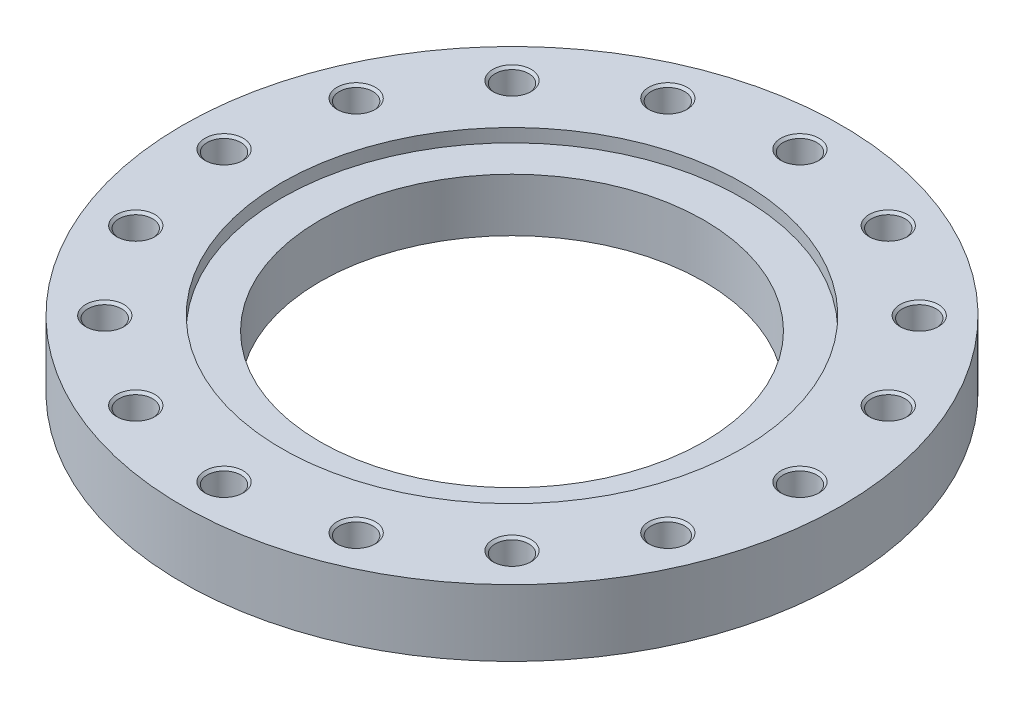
ISO-10303-21;
HEADER;
FILE_DESCRIPTION(('STEP AP214'),'2;1');
FILE_NAME('part.step','',(''),(''),'','','');
FILE_SCHEMA(('AUTOMOTIVE_DESIGN { 1 0 10303 214 1 1 1 1 }'));
ENDSEC;
DATA;
#1=APPLICATION_CONTEXT('core data for automotive mechanical design processes');
#2=APPLICATION_PROTOCOL_DEFINITION('international standard','automotive_design',2000,#1);
#3=PRODUCT_CONTEXT('',#1,'mechanical');
#4=PRODUCT('Part','Part','',(#3));
#5=PRODUCT_RELATED_PRODUCT_CATEGORY('part','',(#4));
#6=PRODUCT_DEFINITION_FORMATION('','',#4);
#7=PRODUCT_DEFINITION_CONTEXT('part definition',#1,'design');
#8=PRODUCT_DEFINITION('design','',#6,#7);
#9=PRODUCT_DEFINITION_SHAPE('','',#8);
#10=(LENGTH_UNIT() NAMED_UNIT(*) SI_UNIT(.MILLI.,.METRE.));
#11=(NAMED_UNIT(*) PLANE_ANGLE_UNIT() SI_UNIT($,.RADIAN.));
#12=(NAMED_UNIT(*) SI_UNIT($,.STERADIAN.) SOLID_ANGLE_UNIT());
#13=UNCERTAINTY_MEASURE_WITH_UNIT(LENGTH_MEASURE(1.E-05),#10,'distance_accuracy_value','');
#14=(GEOMETRIC_REPRESENTATION_CONTEXT(3) GLOBAL_UNCERTAINTY_ASSIGNED_CONTEXT((#13)) GLOBAL_UNIT_ASSIGNED_CONTEXT((#10,
#11,#12)) REPRESENTATION_CONTEXT('',''));
#15=CARTESIAN_POINT('',(0.,0.,0.));
#16=DIRECTION('',(0.,0.,1.));
#17=DIRECTION('',(1.,0.,0.));
#18=AXIS2_PLACEMENT_3D('',#15,#16,#17);
#19=CARTESIAN_POINT('',(0.,26.,0.));
#20=DIRECTION('',(0.,-1.,0.));
#21=DIRECTION('',(1.,0.,0.));
#22=AXIS2_PLACEMENT_3D('',#19,#20,#21);
#23=CYLINDRICAL_SURFACE('',#22,257.5);
#24=CARTESIAN_POINT('',(0.,0.,0.));
#25=DIRECTION('',(0.,1.,0.));
#26=DIRECTION('',(1.,0.,0.));
#27=AXIS2_PLACEMENT_3D('',#24,#25,#26);
#28=CIRCLE('',#27,257.5);
#29=CARTESIAN_POINT('',(257.5,0.,0.));
#30=VERTEX_POINT('',#29);
#31=EDGE_CURVE('E9',#30,#30,#28,.T.);
#32=ORIENTED_EDGE('',*,*,#31,.T.);
#33=EDGE_LOOP('',(#32));
#34=FACE_BOUND('',#33,.T.);
#35=CARTESIAN_POINT('',(0.,52.,0.));
#36=DIRECTION('',(0.,1.,0.));
#37=DIRECTION('',(1.,0.,0.));
#38=AXIS2_PLACEMENT_3D('',#35,#36,#37);
#39=CIRCLE('',#38,257.5);
#40=CARTESIAN_POINT('',(257.5,52.,0.));
#41=VERTEX_POINT('',#40);
#42=EDGE_CURVE('E739',#41,#41,#39,.T.);
#43=ORIENTED_EDGE('',*,*,#42,.F.);
#44=EDGE_LOOP('',(#43));
#45=FACE_BOUND('',#44,.T.);
#46=ADVANCED_FACE('F15',(#34,#45),#23,.T.);
#47=CARTESIAN_POINT('',(203.75,0.,0.));
#48=DIRECTION('',(0.,-1.,0.));
#49=DIRECTION('',(-1.,0.,0.));
#50=AXIS2_PLACEMENT_3D('',#47,#48,#49);
#51=PLANE('',#50);
#52=CARTESIAN_POINT('',(0.,0.,0.));
#53=DIRECTION('',(0.,1.,0.));
#54=DIRECTION('',(1.,0.,0.));
#55=AXIS2_PLACEMENT_3D('',#52,#53,#54);
#56=CIRCLE('',#55,150.);
#57=CARTESIAN_POINT('',(150.,0.,0.));
#58=VERTEX_POINT('',#57);
#59=EDGE_CURVE('E25',#58,#58,#56,.T.);
#60=ORIENTED_EDGE('',*,*,#59,.T.);
#61=EDGE_LOOP('',(#60));
#62=FACE_BOUND('',#61,.T.);
#63=ORIENTED_EDGE('',*,*,#31,.F.);
#64=EDGE_LOOP('',(#63));
#65=FACE_BOUND('',#64,.T.);
#66=ADVANCED_FACE('F247',(#62,#65),#51,.T.);
#67=CARTESIAN_POINT('',(0.,26.,0.));
#68=DIRECTION('',(0.,-1.,0.));
#69=DIRECTION('',(1.,0.,0.));
#70=AXIS2_PLACEMENT_3D('',#67,#68,#69);
#71=CYLINDRICAL_SURFACE('',#70,150.);
#72=ORIENTED_EDGE('',*,*,#59,.F.);
#73=EDGE_LOOP('',(#72));
#74=FACE_BOUND('',#73,.T.);
#75=CARTESIAN_POINT('',(0.,41.6,0.));
#76=DIRECTION('',(0.,1.,0.));
#77=DIRECTION('',(1.,0.,0.));
#78=AXIS2_PLACEMENT_3D('',#75,#76,#77);
#79=CIRCLE('',#78,150.);
#80=CARTESIAN_POINT('',(-150.,41.6,0.));
#81=VERTEX_POINT('',#80);
#82=EDGE_CURVE('E737',#81,#81,#79,.T.);
#83=ORIENTED_EDGE('',*,*,#82,.T.);
#84=EDGE_LOOP('',(#83));
#85=FACE_BOUND('',#84,.T.);
#86=ADVANCED_FACE('F252',(#74,#85),#71,.F.);
#87=CARTESIAN_POINT('',(203.75,52.,0.));
#88=DIRECTION('',(0.,1.,0.));
#89=DIRECTION('',(1.,0.,0.));
#90=AXIS2_PLACEMENT_3D('',#87,#88,#89);
#91=PLANE('',#90);
#92=ORIENTED_EDGE('',*,*,#42,.T.);
#93=EDGE_LOOP('',(#92));
#94=FACE_BOUND('',#93,.T.);
#95=CARTESIAN_POINT('',(0.,52.,0.));
#96=DIRECTION('',(0.,-1.,0.));
#97=DIRECTION('',(1.,0.,0.));
#98=AXIS2_PLACEMENT_3D('',#95,#96,#97);
#99=CIRCLE('',#98,180.);
#100=CARTESIAN_POINT('',(-180.,52.,0.));
#101=VERTEX_POINT('',#100);
#102=EDGE_CURVE('E184',#101,#101,#99,.T.);
#103=ORIENTED_EDGE('',*,*,#102,.T.);
#104=EDGE_LOOP('',(#103));
#105=FACE_BOUND('',#104,.T.);
#106=CARTESIAN_POINT('',(225.,52.,0.));
#107=DIRECTION('',(0.,-1.,0.));
#108=DIRECTION('',(1.,0.,0.));
#109=AXIS2_PLACEMENT_3D('',#106,#107,#108);
#110=CIRCLE('',#109,15.);
#111=CARTESIAN_POINT('',(240.,52.,0.));
#112=VERTEX_POINT('',#111);
#113=EDGE_CURVE('E222',#112,#112,#110,.T.);
#114=ORIENTED_EDGE('',*,*,#113,.T.);
#115=EDGE_LOOP('',(#114));
#116=FACE_BOUND('',#115,.T.);
#117=CARTESIAN_POINT('',(207.87289481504,52.,-86.1037722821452));
#118=DIRECTION('',(0.,-1.,0.));
#119=DIRECTION('',(0.923879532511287,0.,-0.38268343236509));
#120=AXIS2_PLACEMENT_3D('',#117,#118,#119);
#121=CIRCLE('',#120,15.);
#122=CARTESIAN_POINT('',(221.731087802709,52.,-91.8440237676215));
#123=VERTEX_POINT('',#122);
#124=EDGE_CURVE('E209',#123,#123,#121,.T.);
#125=ORIENTED_EDGE('',*,*,#124,.T.);
#126=EDGE_LOOP('',(#125));
#127=FACE_BOUND('',#126,.T.);
#128=CARTESIAN_POINT('',(159.099025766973,52.,-159.099025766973));
#129=DIRECTION('',(0.,-1.,0.));
#130=DIRECTION('',(0.707106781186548,0.,-0.707106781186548));
#131=AXIS2_PLACEMENT_3D('',#128,#129,#130);
#132=CIRCLE('',#131,15.);
#133=CARTESIAN_POINT('',(169.705627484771,52.,-169.705627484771));
#134=VERTEX_POINT('',#133);
#135=EDGE_CURVE('E201',#134,#134,#132,.T.);
#136=ORIENTED_EDGE('',*,*,#135,.T.);
#137=EDGE_LOOP('',(#136));
#138=FACE_BOUND('',#137,.T.);
#139=CARTESIAN_POINT('',(86.1037722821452,52.,-207.87289481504));
#140=DIRECTION('',(0.,-1.,0.));
#141=DIRECTION('',(0.38268343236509,0.,-0.923879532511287));
#142=AXIS2_PLACEMENT_3D('',#139,#140,#141);
#143=CIRCLE('',#142,15.);
#144=CARTESIAN_POINT('',(91.8440237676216,52.,-221.731087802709));
#145=VERTEX_POINT('',#144);
#146=EDGE_CURVE('E575',#145,#145,#143,.T.);
#147=ORIENTED_EDGE('',*,*,#146,.T.);
#148=EDGE_LOOP('',(#147));
#149=FACE_BOUND('',#148,.T.);
#150=CARTESIAN_POINT('',(0.,52.,-225.));
#151=DIRECTION('',(0.,-1.,0.));
#152=DIRECTION('',(0.,0.,-1.));
#153=AXIS2_PLACEMENT_3D('',#150,#151,#152);
#154=CIRCLE('',#153,15.);
#155=CARTESIAN_POINT('',(0.,52.,-240.));
#156=VERTEX_POINT('',#155);
#157=EDGE_CURVE('E561',#156,#156,#154,.T.);
#158=ORIENTED_EDGE('',*,*,#157,.T.);
#159=EDGE_LOOP('',(#158));
#160=FACE_BOUND('',#159,.T.);
#161=CARTESIAN_POINT('',(-86.1037722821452,52.,-207.87289481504));
#162=DIRECTION('',(0.,-1.,0.));
#163=DIRECTION('',(-0.38268343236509,0.,-0.923879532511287));
#164=AXIS2_PLACEMENT_3D('',#161,#162,#163);
#165=CIRCLE('',#164,15.);
#166=CARTESIAN_POINT('',(-91.8440237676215,52.,-221.731087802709));
#167=VERTEX_POINT('',#166);
#168=EDGE_CURVE('E542',#167,#167,#165,.T.);
#169=ORIENTED_EDGE('',*,*,#168,.T.);
#170=EDGE_LOOP('',(#169));
#171=FACE_BOUND('',#170,.T.);
#172=CARTESIAN_POINT('',(-159.099025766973,52.,-159.099025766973));
#173=DIRECTION('',(0.,-1.,0.));
#174=DIRECTION('',(-0.707106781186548,0.,-0.707106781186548));
#175=AXIS2_PLACEMENT_3D('',#172,#173,#174);
#176=CIRCLE('',#175,15.);
#177=CARTESIAN_POINT('',(-169.705627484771,52.,-169.705627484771));
#178=VERTEX_POINT('',#177);
#179=EDGE_CURVE('E712',#178,#178,#176,.T.);
#180=ORIENTED_EDGE('',*,*,#179,.T.);
#181=EDGE_LOOP('',(#180));
#182=FACE_BOUND('',#181,.T.);
#183=CARTESIAN_POINT('',(-207.87289481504,52.,-86.1037722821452));
#184=DIRECTION('',(0.,-1.,0.));
#185=DIRECTION('',(-0.923879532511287,0.,-0.38268343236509));
#186=AXIS2_PLACEMENT_3D('',#183,#184,#185);
#187=CIRCLE('',#186,15.);
#188=CARTESIAN_POINT('',(-221.731087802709,52.,-91.8440237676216));
#189=VERTEX_POINT('',#188);
#190=EDGE_CURVE('E701',#189,#189,#187,.T.);
#191=ORIENTED_EDGE('',*,*,#190,.T.);
#192=EDGE_LOOP('',(#191));
#193=FACE_BOUND('',#192,.T.);
#194=CARTESIAN_POINT('',(-225.,52.,0.));
#195=DIRECTION('',(0.,-1.,0.));
#196=DIRECTION('',(-1.,0.,0.));
#197=AXIS2_PLACEMENT_3D('',#194,#195,#196);
#198=CIRCLE('',#197,15.);
#199=CARTESIAN_POINT('',(-240.,52.,0.));
#200=VERTEX_POINT('',#199);
#201=EDGE_CURVE('E689',#200,#200,#198,.T.);
#202=ORIENTED_EDGE('',*,*,#201,.T.);
#203=EDGE_LOOP('',(#202));
#204=FACE_BOUND('',#203,.T.);
#205=CARTESIAN_POINT('',(-207.87289481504,52.,86.1037722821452));
#206=DIRECTION('',(0.,-1.,0.));
#207=DIRECTION('',(-0.923879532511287,0.,0.38268343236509));
#208=AXIS2_PLACEMENT_3D('',#205,#206,#207);
#209=CIRCLE('',#208,15.);
#210=CARTESIAN_POINT('',(-221.731087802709,52.,91.8440237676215));
#211=VERTEX_POINT('',#210);
#212=EDGE_CURVE('E800',#211,#211,#209,.T.);
#213=ORIENTED_EDGE('',*,*,#212,.T.);
#214=EDGE_LOOP('',(#213));
#215=FACE_BOUND('',#214,.T.);
#216=CARTESIAN_POINT('',(-159.099025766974,52.,159.099025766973));
#217=DIRECTION('',(0.,-1.,0.));
#218=DIRECTION('',(-0.707106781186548,0.,0.707106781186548));
#219=AXIS2_PLACEMENT_3D('',#216,#217,#218);
#220=CIRCLE('',#219,15.);
#221=CARTESIAN_POINT('',(-169.705627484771,52.,169.705627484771));
#222=VERTEX_POINT('',#221);
#223=EDGE_CURVE('E760',#222,#222,#220,.T.);
#224=ORIENTED_EDGE('',*,*,#223,.T.);
#225=EDGE_LOOP('',(#224));
#226=FACE_BOUND('',#225,.T.);
#227=CARTESIAN_POINT('',(-86.1037722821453,52.,207.87289481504));
#228=DIRECTION('',(0.,-1.,0.));
#229=DIRECTION('',(-0.382683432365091,0.,0.923879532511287));
#230=AXIS2_PLACEMENT_3D('',#227,#228,#229);
#231=CIRCLE('',#230,15.);
#232=CARTESIAN_POINT('',(-91.8440237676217,52.,221.731087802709));
#233=VERTEX_POINT('',#232);
#234=EDGE_CURVE('E781',#233,#233,#231,.T.);
#235=ORIENTED_EDGE('',*,*,#234,.T.);
#236=EDGE_LOOP('',(#235));
#237=FACE_BOUND('',#236,.T.);
#238=CARTESIAN_POINT('',(0.,52.,225.));
#239=DIRECTION('',(0.,-1.,0.));
#240=DIRECTION('',(0.,0.,1.));
#241=AXIS2_PLACEMENT_3D('',#238,#239,#240);
#242=CIRCLE('',#241,15.);
#243=CARTESIAN_POINT('',(0.,52.,240.));
#244=VERTEX_POINT('',#243);
#245=EDGE_CURVE('E772',#244,#244,#242,.T.);
#246=ORIENTED_EDGE('',*,*,#245,.T.);
#247=EDGE_LOOP('',(#246));
#248=FACE_BOUND('',#247,.T.);
#249=CARTESIAN_POINT('',(86.1037722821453,52.,207.87289481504));
#250=DIRECTION('',(0.,-1.,0.));
#251=DIRECTION('',(0.38268343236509,0.,0.923879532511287));
#252=AXIS2_PLACEMENT_3D('',#249,#250,#251);
#253=CIRCLE('',#252,15.);
#254=CARTESIAN_POINT('',(91.8440237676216,52.,221.731087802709));
#255=VERTEX_POINT('',#254);
#256=EDGE_CURVE('E742',#255,#255,#253,.T.);
#257=ORIENTED_EDGE('',*,*,#256,.T.);
#258=EDGE_LOOP('',(#257));
#259=FACE_BOUND('',#258,.T.);
#260=CARTESIAN_POINT('',(159.099025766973,52.,159.099025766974));
#261=DIRECTION('',(0.,-1.,0.));
#262=DIRECTION('',(0.707106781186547,0.,0.707106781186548));
#263=AXIS2_PLACEMENT_3D('',#260,#261,#262);
#264=CIRCLE('',#263,15.);
#265=CARTESIAN_POINT('',(169.705627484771,52.,169.705627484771));
#266=VERTEX_POINT('',#265);
#267=EDGE_CURVE('E751',#266,#266,#264,.T.);
#268=ORIENTED_EDGE('',*,*,#267,.T.);
#269=EDGE_LOOP('',(#268));
#270=FACE_BOUND('',#269,.T.);
#271=CARTESIAN_POINT('',(207.87289481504,52.,86.1037722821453));
#272=DIRECTION('',(0.,-1.,0.));
#273=DIRECTION('',(0.923879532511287,0.,0.382683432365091));
#274=AXIS2_PLACEMENT_3D('',#271,#272,#273);
#275=CIRCLE('',#274,15.);
#276=CARTESIAN_POINT('',(221.731087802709,52.,91.8440237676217));
#277=VERTEX_POINT('',#276);
#278=EDGE_CURVE('E727',#277,#277,#275,.T.);
#279=ORIENTED_EDGE('',*,*,#278,.T.);
#280=EDGE_LOOP('',(#279));
#281=FACE_BOUND('',#280,.T.);
#282=ADVANCED_FACE('F267',(#94,#105,#116,#127,#138,#149,#160,#171,#182,#193,#204,#215,#226,#237,
#248,#259,#270,#281),#91,.T.);
#283=CARTESIAN_POINT('',(0.,41.6,0.));
#284=DIRECTION('',(0.,-1.,0.));
#285=DIRECTION('',(-1.,0.,0.));
#286=AXIS2_PLACEMENT_3D('',#283,#284,#285);
#287=PLANE('',#286);
#288=CARTESIAN_POINT('',(0.,41.6,0.));
#289=DIRECTION('',(0.,-1.,0.));
#290=DIRECTION('',(1.,0.,0.));
#291=AXIS2_PLACEMENT_3D('',#288,#289,#290);
#292=CIRCLE('',#291,180.);
#293=CARTESIAN_POINT('',(180.,41.6,0.));
#294=VERTEX_POINT('',#293);
#295=EDGE_CURVE('E19',#294,#294,#292,.T.);
#296=ORIENTED_EDGE('',*,*,#295,.F.);
#297=EDGE_LOOP('',(#296));
#298=FACE_BOUND('',#297,.T.);
#299=ORIENTED_EDGE('',*,*,#82,.F.);
#300=EDGE_LOOP('',(#299));
#301=FACE_BOUND('',#300,.T.);
#302=ADVANCED_FACE('F17',(#298,#301),#287,.F.);
#303=CARTESIAN_POINT('',(0.,49.4,0.));
#304=DIRECTION('',(0.,-1.,0.));
#305=DIRECTION('',(1.,0.,0.));
#306=AXIS2_PLACEMENT_3D('',#303,#304,#305);
#307=CYLINDRICAL_SURFACE('',#306,180.);
#308=ORIENTED_EDGE('',*,*,#295,.T.);
#309=EDGE_LOOP('',(#308));
#310=FACE_BOUND('',#309,.T.);
#311=ORIENTED_EDGE('',*,*,#102,.F.);
#312=EDGE_LOOP('',(#311));
#313=FACE_BOUND('',#312,.T.);
#314=ADVANCED_FACE('F243',(#310,#313),#307,.F.);
#315=CARTESIAN_POINT('',(225.,8.21673193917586,0.));
#316=DIRECTION('',(0.,1.,0.));
#317=DIRECTION('',(1.,0.,0.));
#318=AXIS2_PLACEMENT_3D('',#315,#316,#317);
#319=CONICAL_SURFACE('',#318,6.5528125,1.0471975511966);
#320=CARTESIAN_POINT('',(225.,12.,0.));
#321=DIRECTION('',(0.,-1.,0.));
#322=DIRECTION('',(1.,0.,0.));
#323=AXIS2_PLACEMENT_3D('',#320,#321,#322);
#324=CIRCLE('',#323,13.105625);
#325=CARTESIAN_POINT('',(238.105625,12.,0.));
#326=VERTEX_POINT('',#325);
#327=EDGE_CURVE('E181',#326,#326,#324,.T.);
#328=ORIENTED_EDGE('',*,*,#327,.F.);
#329=EDGE_LOOP('',(#328));
#330=FACE_BOUND('',#329,.T.);
#331=CARTESIAN_POINT('',(225.,4.43346387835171,0.));
#332=VERTEX_POINT('',#331);
#333=VERTEX_LOOP('',#332);
#334=FACE_BOUND('',#333,.T.);
#335=ADVANCED_FACE('F237',(#330,#334),#319,.F.);
#336=CARTESIAN_POINT('',(225.,16.0528125,0.));
#337=DIRECTION('',(0.,1.,0.));
#338=DIRECTION('',(1.,0.,0.));
#339=AXIS2_PLACEMENT_3D('',#336,#337,#338);
#340=CYLINDRICAL_SURFACE('',#339,13.105625);
#341=CARTESIAN_POINT('',(225.,20.105625,0.));
#342=DIRECTION('',(0.,-1.,0.));
#343=DIRECTION('',(1.,0.,0.));
#344=AXIS2_PLACEMENT_3D('',#341,#342,#343);
#345=CIRCLE('',#344,13.105625);
#346=CARTESIAN_POINT('',(238.105625,20.105625,0.));
#347=VERTEX_POINT('',#346);
#348=EDGE_CURVE('E185',#347,#347,#345,.T.);
#349=ORIENTED_EDGE('',*,*,#348,.F.);
#350=EDGE_LOOP('',(#349));
#351=FACE_BOUND('',#350,.T.);
#352=ORIENTED_EDGE('',*,*,#327,.T.);
#353=EDGE_LOOP('',(#352));
#354=FACE_BOUND('',#353,.T.);
#355=ADVANCED_FACE('F182',(#351,#354),#340,.F.);
#356=CARTESIAN_POINT('',(225.,21.0528125,0.));
#357=DIRECTION('',(0.,1.,0.));
#358=DIRECTION('',(1.,0.,0.));
#359=AXIS2_PLACEMENT_3D('',#356,#357,#358);
#360=CONICAL_SURFACE('',#359,14.0528125,0.785398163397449);
#361=CARTESIAN_POINT('',(225.,22.,0.));
#362=DIRECTION('',(0.,-1.,0.));
#363=DIRECTION('',(1.,0.,0.));
#364=AXIS2_PLACEMENT_3D('',#361,#362,#363);
#365=CIRCLE('',#364,15.);
#366=CARTESIAN_POINT('',(240.,22.,0.));
#367=VERTEX_POINT('',#366);
#368=EDGE_CURVE('E188',#367,#367,#365,.T.);
#369=ORIENTED_EDGE('',*,*,#368,.F.);
#370=EDGE_LOOP('',(#369));
#371=FACE_BOUND('',#370,.T.);
#372=ORIENTED_EDGE('',*,*,#348,.T.);
#373=EDGE_LOOP('',(#372));
#374=FACE_BOUND('',#373,.T.);
#375=ADVANCED_FACE('F230',(#371,#374),#360,.F.);
#376=CARTESIAN_POINT('',(239.0528125,22.,0.));
#377=DIRECTION('',(0.,1.,0.));
#378=DIRECTION('',(-1.,0.,0.));
#379=AXIS2_PLACEMENT_3D('',#376,#377,#378);
#380=PLANE('',#379);
#381=CARTESIAN_POINT('',(225.,22.,0.));
#382=DIRECTION('',(0.,-1.,0.));
#383=DIRECTION('',(1.,0.,0.));
#384=AXIS2_PLACEMENT_3D('',#381,#382,#383);
#385=CIRCLE('',#384,13.105625);
#386=CARTESIAN_POINT('',(238.105625,22.,0.));
#387=VERTEX_POINT('',#386);
#388=EDGE_CURVE('E223',#387,#387,#385,.T.);
#389=ORIENTED_EDGE('',*,*,#388,.F.);
#390=EDGE_LOOP('',(#389));
#391=FACE_BOUND('',#390,.T.);
#392=ORIENTED_EDGE('',*,*,#368,.T.);
#393=EDGE_LOOP('',(#392));
#394=FACE_BOUND('',#393,.T.);
#395=ADVANCED_FACE('F228',(#391,#394),#380,.F.);
#396=CARTESIAN_POINT('',(225.,36.0528125,0.));
#397=DIRECTION('',(0.,1.,0.));
#398=DIRECTION('',(1.,0.,0.));
#399=AXIS2_PLACEMENT_3D('',#396,#397,#398);
#400=CYLINDRICAL_SURFACE('',#399,13.105625);
#401=CARTESIAN_POINT('',(225.,50.105625,0.));
#402=DIRECTION('',(0.,-1.,0.));
#403=DIRECTION('',(1.,0.,0.));
#404=AXIS2_PLACEMENT_3D('',#401,#402,#403);
#405=CIRCLE('',#404,13.105625);
#406=CARTESIAN_POINT('',(238.105625,50.105625,0.));
#407=VERTEX_POINT('',#406);
#408=EDGE_CURVE('E219',#407,#407,#405,.T.);
#409=ORIENTED_EDGE('',*,*,#408,.F.);
#410=EDGE_LOOP('',(#409));
#411=FACE_BOUND('',#410,.T.);
#412=ORIENTED_EDGE('',*,*,#388,.T.);
#413=EDGE_LOOP('',(#412));
#414=FACE_BOUND('',#413,.T.);
#415=ADVANCED_FACE('F1016',(#411,#414),#400,.F.);
#416=CARTESIAN_POINT('',(225.,51.0528125,0.));
#417=DIRECTION('',(0.,1.,0.));
#418=DIRECTION('',(1.,0.,0.));
#419=AXIS2_PLACEMENT_3D('',#416,#417,#418);
#420=CONICAL_SURFACE('',#419,14.0528125,0.785398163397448);
#421=ORIENTED_EDGE('',*,*,#113,.F.);
#422=EDGE_LOOP('',(#421));
#423=FACE_BOUND('',#422,.T.);
#424=ORIENTED_EDGE('',*,*,#408,.T.);
#425=EDGE_LOOP('',(#424));
#426=FACE_BOUND('',#425,.T.);
#427=ADVANCED_FACE('F861',(#423,#426),#420,.F.);
#428=CARTESIAN_POINT('',(207.87289481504,8.21673193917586,-86.1037722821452));
#429=DIRECTION('',(0.,1.,0.));
#430=DIRECTION('',(0.923879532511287,0.,-0.38268343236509));
#431=AXIS2_PLACEMENT_3D('',#428,#429,#430);
#432=CONICAL_SURFACE('',#431,6.5528125,1.0471975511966);
#433=CARTESIAN_POINT('',(207.87289481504,12.,-86.1037722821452));
#434=DIRECTION('',(0.,-1.,0.));
#435=DIRECTION('',(0.923879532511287,0.,-0.38268343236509));
#436=AXIS2_PLACEMENT_3D('',#433,#434,#435);
#437=CIRCLE('',#436,13.105625);
#438=CARTESIAN_POINT('',(219.980913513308,12.,-91.1190778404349));
#439=VERTEX_POINT('',#438);
#440=EDGE_CURVE('E218',#439,#439,#437,.T.);
#441=ORIENTED_EDGE('',*,*,#440,.F.);
#442=EDGE_LOOP('',(#441));
#443=FACE_BOUND('',#442,.T.);
#444=CARTESIAN_POINT('',(207.87289481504,4.43346387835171,-86.1037722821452));
#445=VERTEX_POINT('',#444);
#446=VERTEX_LOOP('',#445);
#447=FACE_BOUND('',#446,.T.);
#448=ADVANCED_FACE('F858',(#443,#447),#432,.F.);
#449=CARTESIAN_POINT('',(207.87289481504,16.0528125,-86.1037722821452));
#450=DIRECTION('',(0.,1.,0.));
#451=DIRECTION('',(0.923879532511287,0.,-0.38268343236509));
#452=AXIS2_PLACEMENT_3D('',#449,#450,#451);
#453=CYLINDRICAL_SURFACE('',#452,13.105625);
#454=CARTESIAN_POINT('',(207.87289481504,20.105625,-86.1037722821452));
#455=DIRECTION('',(0.,-1.,0.));
#456=DIRECTION('',(0.923879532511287,0.,-0.38268343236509));
#457=AXIS2_PLACEMENT_3D('',#454,#455,#456);
#458=CIRCLE('',#457,13.105625);
#459=CARTESIAN_POINT('',(219.980913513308,20.105625,-91.1190778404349));
#460=VERTEX_POINT('',#459);
#461=EDGE_CURVE('E215',#460,#460,#458,.T.);
#462=ORIENTED_EDGE('',*,*,#461,.F.);
#463=EDGE_LOOP('',(#462));
#464=FACE_BOUND('',#463,.T.);
#465=ORIENTED_EDGE('',*,*,#440,.T.);
#466=EDGE_LOOP('',(#465));
#467=FACE_BOUND('',#466,.T.);
#468=ADVANCED_FACE('F860',(#464,#467),#453,.F.);
#469=CARTESIAN_POINT('',(207.87289481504,21.0528125,-86.1037722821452));
#470=DIRECTION('',(0.,1.,0.));
#471=DIRECTION('',(0.923879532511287,0.,-0.38268343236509));
#472=AXIS2_PLACEMENT_3D('',#469,#470,#471);
#473=CONICAL_SURFACE('',#472,14.0528125,0.785398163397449);
#474=CARTESIAN_POINT('',(207.87289481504,22.,-86.1037722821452));
#475=DIRECTION('',(0.,-1.,0.));
#476=DIRECTION('',(0.923879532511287,0.,-0.38268343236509));
#477=AXIS2_PLACEMENT_3D('',#474,#475,#476);
#478=CIRCLE('',#477,15.);
#479=CARTESIAN_POINT('',(221.731087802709,22.,-91.8440237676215));
#480=VERTEX_POINT('',#479);
#481=EDGE_CURVE('E214',#480,#480,#478,.T.);
#482=ORIENTED_EDGE('',*,*,#481,.F.);
#483=EDGE_LOOP('',(#482));
#484=FACE_BOUND('',#483,.T.);
#485=ORIENTED_EDGE('',*,*,#461,.T.);
#486=EDGE_LOOP('',(#485));
#487=FACE_BOUND('',#486,.T.);
#488=ADVANCED_FACE('F359',(#484,#487),#473,.F.);
#489=CARTESIAN_POINT('',(220.856000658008,22.,-91.4815508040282));
#490=DIRECTION('',(0.,1.,0.));
#491=DIRECTION('',(-0.923879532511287,0.,0.38268343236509));
#492=AXIS2_PLACEMENT_3D('',#489,#490,#491);
#493=PLANE('',#492);
#494=CARTESIAN_POINT('',(207.87289481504,22.,-86.1037722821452));
#495=DIRECTION('',(0.,-1.,0.));
#496=DIRECTION('',(0.923879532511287,0.,-0.38268343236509));
#497=AXIS2_PLACEMENT_3D('',#494,#495,#496);
#498=CIRCLE('',#497,13.105625);
#499=CARTESIAN_POINT('',(219.980913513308,22.,-91.1190778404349));
#500=VERTEX_POINT('',#499);
#501=EDGE_CURVE('E211',#500,#500,#498,.T.);
#502=ORIENTED_EDGE('',*,*,#501,.F.);
#503=EDGE_LOOP('',(#502));
#504=FACE_BOUND('',#503,.T.);
#505=ORIENTED_EDGE('',*,*,#481,.T.);
#506=EDGE_LOOP('',(#505));
#507=FACE_BOUND('',#506,.T.);
#508=ADVANCED_FACE('F355',(#504,#507),#493,.F.);
#509=CARTESIAN_POINT('',(207.87289481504,36.0528125,-86.1037722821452));
#510=DIRECTION('',(0.,1.,0.));
#511=DIRECTION('',(0.923879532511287,0.,-0.38268343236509));
#512=AXIS2_PLACEMENT_3D('',#509,#510,#511);
#513=CYLINDRICAL_SURFACE('',#512,13.105625);
#514=CARTESIAN_POINT('',(207.87289481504,50.105625,-86.1037722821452));
#515=DIRECTION('',(0.,-1.,0.));
#516=DIRECTION('',(0.923879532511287,0.,-0.38268343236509));
#517=AXIS2_PLACEMENT_3D('',#514,#515,#516);
#518=CIRCLE('',#517,13.105625);
#519=CARTESIAN_POINT('',(219.980913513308,50.105625,-91.1190778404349));
#520=VERTEX_POINT('',#519);
#521=EDGE_CURVE('E212',#520,#520,#518,.T.);
#522=ORIENTED_EDGE('',*,*,#521,.F.);
#523=EDGE_LOOP('',(#522));
#524=FACE_BOUND('',#523,.T.);
#525=ORIENTED_EDGE('',*,*,#501,.T.);
#526=EDGE_LOOP('',(#525));
#527=FACE_BOUND('',#526,.T.);
#528=ADVANCED_FACE('F358',(#524,#527),#513,.F.);
#529=CARTESIAN_POINT('',(207.87289481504,51.0528125,-86.1037722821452));
#530=DIRECTION('',(0.,1.,0.));
#531=DIRECTION('',(0.923879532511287,0.,-0.38268343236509));
#532=AXIS2_PLACEMENT_3D('',#529,#530,#531);
#533=CONICAL_SURFACE('',#532,14.0528125,0.785398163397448);
#534=ORIENTED_EDGE('',*,*,#124,.F.);
#535=EDGE_LOOP('',(#534));
#536=FACE_BOUND('',#535,.T.);
#537=ORIENTED_EDGE('',*,*,#521,.T.);
#538=EDGE_LOOP('',(#537));
#539=FACE_BOUND('',#538,.T.);
#540=ADVANCED_FACE('F907',(#536,#539),#533,.F.);
#541=CARTESIAN_POINT('',(159.099025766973,8.21673193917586,-159.099025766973));
#542=DIRECTION('',(0.,1.,0.));
#543=DIRECTION('',(0.707106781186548,0.,-0.707106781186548));
#544=AXIS2_PLACEMENT_3D('',#541,#542,#543);
#545=CONICAL_SURFACE('',#544,6.5528125,1.0471975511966);
#546=CARTESIAN_POINT('',(159.099025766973,12.,-159.099025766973));
#547=DIRECTION('',(0.,-1.,0.));
#548=DIRECTION('',(0.707106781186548,0.,-0.707106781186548));
#549=AXIS2_PLACEMENT_3D('',#546,#547,#548);
#550=CIRCLE('',#549,13.105625);
#551=CARTESIAN_POINT('',(168.366102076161,12.,-168.366102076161));
#552=VERTEX_POINT('',#551);
#553=EDGE_CURVE('E769',#552,#552,#550,.T.);
#554=ORIENTED_EDGE('',*,*,#553,.F.);
#555=EDGE_LOOP('',(#554));
#556=FACE_BOUND('',#555,.T.);
#557=CARTESIAN_POINT('',(159.099025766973,4.43346387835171,-159.099025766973));
#558=VERTEX_POINT('',#557);
#559=VERTEX_LOOP('',#558);
#560=FACE_BOUND('',#559,.T.);
#561=ADVANCED_FACE('F910',(#556,#560),#545,.F.);
#562=CARTESIAN_POINT('',(159.099025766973,16.0528125,-159.099025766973));
#563=DIRECTION('',(0.,1.,0.));
#564=DIRECTION('',(0.707106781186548,0.,-0.707106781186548));
#565=AXIS2_PLACEMENT_3D('',#562,#563,#564);
#566=CYLINDRICAL_SURFACE('',#565,13.105625);
#567=CARTESIAN_POINT('',(159.099025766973,20.105625,-159.099025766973));
#568=DIRECTION('',(0.,-1.,0.));
#569=DIRECTION('',(0.707106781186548,0.,-0.707106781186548));
#570=AXIS2_PLACEMENT_3D('',#567,#568,#569);
#571=CIRCLE('',#570,13.105625);
#572=CARTESIAN_POINT('',(168.366102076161,20.105625,-168.366102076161));
#573=VERTEX_POINT('',#572);
#574=EDGE_CURVE('E208',#573,#573,#571,.T.);
#575=ORIENTED_EDGE('',*,*,#574,.F.);
#576=EDGE_LOOP('',(#575));
#577=FACE_BOUND('',#576,.T.);
#578=ORIENTED_EDGE('',*,*,#553,.T.);
#579=EDGE_LOOP('',(#578));
#580=FACE_BOUND('',#579,.T.);
#581=ADVANCED_FACE('F918',(#577,#580),#566,.F.);
#582=CARTESIAN_POINT('',(159.099025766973,21.0528125,-159.099025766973));
#583=DIRECTION('',(0.,1.,0.));
#584=DIRECTION('',(0.707106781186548,0.,-0.707106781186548));
#585=AXIS2_PLACEMENT_3D('',#582,#583,#584);
#586=CONICAL_SURFACE('',#585,14.0528125,0.785398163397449);
#587=CARTESIAN_POINT('',(159.099025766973,22.,-159.099025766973));
#588=DIRECTION('',(0.,-1.,0.));
#589=DIRECTION('',(0.707106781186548,0.,-0.707106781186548));
#590=AXIS2_PLACEMENT_3D('',#587,#588,#589);
#591=CIRCLE('',#590,15.);
#592=CARTESIAN_POINT('',(169.705627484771,22.,-169.705627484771));
#593=VERTEX_POINT('',#592);
#594=EDGE_CURVE('E205',#593,#593,#591,.T.);
#595=ORIENTED_EDGE('',*,*,#594,.F.);
#596=EDGE_LOOP('',(#595));
#597=FACE_BOUND('',#596,.T.);
#598=ORIENTED_EDGE('',*,*,#574,.T.);
#599=EDGE_LOOP('',(#598));
#600=FACE_BOUND('',#599,.T.);
#601=ADVANCED_FACE('F965',(#597,#600),#586,.F.);
#602=CARTESIAN_POINT('',(169.035864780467,22.,-169.035864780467));
#603=DIRECTION('',(0.,1.,0.));
#604=DIRECTION('',(-0.707106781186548,0.,0.707106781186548));
#605=AXIS2_PLACEMENT_3D('',#602,#603,#604);
#606=PLANE('',#605);
#607=CARTESIAN_POINT('',(159.099025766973,22.,-159.099025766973));
#608=DIRECTION('',(0.,-1.,0.));
#609=DIRECTION('',(0.707106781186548,0.,-0.707106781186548));
#610=AXIS2_PLACEMENT_3D('',#607,#608,#609);
#611=CIRCLE('',#610,13.105625);
#612=CARTESIAN_POINT('',(168.366102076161,22.,-168.366102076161));
#613=VERTEX_POINT('',#612);
#614=EDGE_CURVE('E203',#613,#613,#611,.T.);
#615=ORIENTED_EDGE('',*,*,#614,.F.);
#616=EDGE_LOOP('',(#615));
#617=FACE_BOUND('',#616,.T.);
#618=ORIENTED_EDGE('',*,*,#594,.T.);
#619=EDGE_LOOP('',(#618));
#620=FACE_BOUND('',#619,.T.);
#621=ADVANCED_FACE('F967',(#617,#620),#606,.F.);
#622=CARTESIAN_POINT('',(159.099025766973,36.0528125,-159.099025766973));
#623=DIRECTION('',(0.,1.,0.));
#624=DIRECTION('',(0.707106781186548,0.,-0.707106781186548));
#625=AXIS2_PLACEMENT_3D('',#622,#623,#624);
#626=CYLINDRICAL_SURFACE('',#625,13.105625);
#627=CARTESIAN_POINT('',(159.099025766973,50.105625,-159.099025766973));
#628=DIRECTION('',(0.,-1.,0.));
#629=DIRECTION('',(0.707106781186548,0.,-0.707106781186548));
#630=AXIS2_PLACEMENT_3D('',#627,#628,#629);
#631=CIRCLE('',#630,13.105625);
#632=CARTESIAN_POINT('',(168.366102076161,50.105625,-168.366102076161));
#633=VERTEX_POINT('',#632);
#634=EDGE_CURVE('E200',#633,#633,#631,.T.);
#635=ORIENTED_EDGE('',*,*,#634,.F.);
#636=EDGE_LOOP('',(#635));
#637=FACE_BOUND('',#636,.T.);
#638=ORIENTED_EDGE('',*,*,#614,.T.);
#639=EDGE_LOOP('',(#638));
#640=FACE_BOUND('',#639,.T.);
#641=ADVANCED_FACE('F883',(#637,#640),#626,.F.);
#642=CARTESIAN_POINT('',(159.099025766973,51.0528125,-159.099025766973));
#643=DIRECTION('',(0.,1.,0.));
#644=DIRECTION('',(0.707106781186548,0.,-0.707106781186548));
#645=AXIS2_PLACEMENT_3D('',#642,#643,#644);
#646=CONICAL_SURFACE('',#645,14.0528125,0.785398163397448);
#647=ORIENTED_EDGE('',*,*,#135,.F.);
#648=EDGE_LOOP('',(#647));
#649=FACE_BOUND('',#648,.T.);
#650=ORIENTED_EDGE('',*,*,#634,.T.);
#651=EDGE_LOOP('',(#650));
#652=FACE_BOUND('',#651,.T.);
#653=ADVANCED_FACE('F446',(#649,#652),#646,.F.);
#654=CARTESIAN_POINT('',(86.1037722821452,8.21673193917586,-207.87289481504));
#655=DIRECTION('',(0.,1.,0.));
#656=DIRECTION('',(0.38268343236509,0.,-0.923879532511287));
#657=AXIS2_PLACEMENT_3D('',#654,#655,#656);
#658=CONICAL_SURFACE('',#657,6.5528125,1.0471975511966);
#659=CARTESIAN_POINT('',(86.1037722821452,12.,-207.87289481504));
#660=DIRECTION('',(0.,-1.,0.));
#661=DIRECTION('',(0.38268343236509,0.,-0.923879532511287));
#662=AXIS2_PLACEMENT_3D('',#659,#660,#661);
#663=CIRCLE('',#662,13.105625);
#664=CARTESIAN_POINT('',(91.1190778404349,12.,-219.980913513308));
#665=VERTEX_POINT('',#664);
#666=EDGE_CURVE('E198',#665,#665,#663,.T.);
#667=ORIENTED_EDGE('',*,*,#666,.F.);
#668=EDGE_LOOP('',(#667));
#669=FACE_BOUND('',#668,.T.);
#670=CARTESIAN_POINT('',(86.1037722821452,4.43346387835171,-207.87289481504));
#671=VERTEX_POINT('',#670);
#672=VERTEX_LOOP('',#671);
#673=FACE_BOUND('',#672,.T.);
#674=ADVANCED_FACE('F436',(#669,#673),#658,.F.);
#675=CARTESIAN_POINT('',(86.1037722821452,16.0528125,-207.87289481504));
#676=DIRECTION('',(0.,1.,0.));
#677=DIRECTION('',(0.38268343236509,0.,-0.923879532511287));
#678=AXIS2_PLACEMENT_3D('',#675,#676,#677);
#679=CYLINDRICAL_SURFACE('',#678,13.105625);
#680=CARTESIAN_POINT('',(86.1037722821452,20.105625,-207.87289481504));
#681=DIRECTION('',(0.,-1.,0.));
#682=DIRECTION('',(0.38268343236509,0.,-0.923879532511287));
#683=AXIS2_PLACEMENT_3D('',#680,#681,#682);
#684=CIRCLE('',#683,13.105625);
#685=CARTESIAN_POINT('',(91.1190778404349,20.105625,-219.980913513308));
#686=VERTEX_POINT('',#685);
#687=EDGE_CURVE('E196',#686,#686,#684,.T.);
#688=ORIENTED_EDGE('',*,*,#687,.F.);
#689=EDGE_LOOP('',(#688));
#690=FACE_BOUND('',#689,.T.);
#691=ORIENTED_EDGE('',*,*,#666,.T.);
#692=EDGE_LOOP('',(#691));
#693=FACE_BOUND('',#692,.T.);
#694=ADVANCED_FACE('F431',(#690,#693),#679,.F.);
#695=CARTESIAN_POINT('',(86.1037722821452,21.0528125,-207.87289481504));
#696=DIRECTION('',(0.,1.,0.));
#697=DIRECTION('',(0.38268343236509,0.,-0.923879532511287));
#698=AXIS2_PLACEMENT_3D('',#695,#696,#697);
#699=CONICAL_SURFACE('',#698,14.0528125,0.785398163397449);
#700=CARTESIAN_POINT('',(86.1037722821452,22.,-207.87289481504));
#701=DIRECTION('',(0.,-1.,0.));
#702=DIRECTION('',(0.38268343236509,0.,-0.923879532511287));
#703=AXIS2_PLACEMENT_3D('',#700,#701,#702);
#704=CIRCLE('',#703,15.);
#705=CARTESIAN_POINT('',(91.8440237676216,22.,-221.731087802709));
#706=VERTEX_POINT('',#705);
#707=EDGE_CURVE('E193',#706,#706,#704,.T.);
#708=ORIENTED_EDGE('',*,*,#707,.F.);
#709=EDGE_LOOP('',(#708));
#710=FACE_BOUND('',#709,.T.);
#711=ORIENTED_EDGE('',*,*,#687,.T.);
#712=EDGE_LOOP('',(#711));
#713=FACE_BOUND('',#712,.T.);
#714=ADVANCED_FACE('F428',(#710,#713),#699,.F.);
#715=CARTESIAN_POINT('',(91.4815508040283,22.,-220.856000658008));
#716=DIRECTION('',(0.,1.,0.));
#717=DIRECTION('',(-0.38268343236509,0.,0.923879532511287));
#718=AXIS2_PLACEMENT_3D('',#715,#716,#717);
#719=PLANE('',#718);
#720=CARTESIAN_POINT('',(86.1037722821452,22.,-207.87289481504));
#721=DIRECTION('',(0.,-1.,0.));
#722=DIRECTION('',(0.38268343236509,0.,-0.923879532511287));
#723=AXIS2_PLACEMENT_3D('',#720,#721,#722);
#724=CIRCLE('',#723,13.105625);
#725=CARTESIAN_POINT('',(91.1190778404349,22.,-219.980913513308));
#726=VERTEX_POINT('',#725);
#727=EDGE_CURVE('E191',#726,#726,#724,.T.);
#728=ORIENTED_EDGE('',*,*,#727,.F.);
#729=EDGE_LOOP('',(#728));
#730=FACE_BOUND('',#729,.T.);
#731=ORIENTED_EDGE('',*,*,#707,.T.);
#732=EDGE_LOOP('',(#731));
#733=FACE_BOUND('',#732,.T.);
#734=ADVANCED_FACE('F425',(#730,#733),#719,.F.);
#735=CARTESIAN_POINT('',(86.1037722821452,36.0528125,-207.87289481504));
#736=DIRECTION('',(0.,1.,0.));
#737=DIRECTION('',(0.38268343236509,0.,-0.923879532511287));
#738=AXIS2_PLACEMENT_3D('',#735,#736,#737);
#739=CYLINDRICAL_SURFACE('',#738,13.105625);
#740=CARTESIAN_POINT('',(86.1037722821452,50.105625,-207.87289481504));
#741=DIRECTION('',(0.,-1.,0.));
#742=DIRECTION('',(0.38268343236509,0.,-0.923879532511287));
#743=AXIS2_PLACEMENT_3D('',#740,#741,#742);
#744=CIRCLE('',#743,13.105625);
#745=CARTESIAN_POINT('',(91.1190778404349,50.105625,-219.980913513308));
#746=VERTEX_POINT('',#745);
#747=EDGE_CURVE('E573',#746,#746,#744,.T.);
#748=ORIENTED_EDGE('',*,*,#747,.F.);
#749=EDGE_LOOP('',(#748));
#750=FACE_BOUND('',#749,.T.);
#751=ORIENTED_EDGE('',*,*,#727,.T.);
#752=EDGE_LOOP('',(#751));
#753=FACE_BOUND('',#752,.T.);
#754=ADVANCED_FACE('F422',(#750,#753),#739,.F.);
#755=CARTESIAN_POINT('',(86.1037722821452,51.0528125,-207.87289481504));
#756=DIRECTION('',(0.,1.,0.));
#757=DIRECTION('',(0.38268343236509,0.,-0.923879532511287));
#758=AXIS2_PLACEMENT_3D('',#755,#756,#757);
#759=CONICAL_SURFACE('',#758,14.0528125,0.785398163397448);
#760=ORIENTED_EDGE('',*,*,#146,.F.);
#761=EDGE_LOOP('',(#760));
#762=FACE_BOUND('',#761,.T.);
#763=ORIENTED_EDGE('',*,*,#747,.T.);
#764=EDGE_LOOP('',(#763));
#765=FACE_BOUND('',#764,.T.);
#766=ADVANCED_FACE('F420',(#762,#765),#759,.F.);
#767=CARTESIAN_POINT('',(0.,8.21673193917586,-225.));
#768=DIRECTION('',(0.,1.,0.));
#769=DIRECTION('',(0.,0.,-1.));
#770=AXIS2_PLACEMENT_3D('',#767,#768,#769);
#771=CONICAL_SURFACE('',#770,6.5528125,1.0471975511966);
#772=CARTESIAN_POINT('',(0.,12.,-225.));
#773=DIRECTION('',(0.,-1.,0.));
#774=DIRECTION('',(0.,0.,-1.));
#775=AXIS2_PLACEMENT_3D('',#772,#773,#774);
#776=CIRCLE('',#775,13.105625);
#777=CARTESIAN_POINT('',(0.,12.,-238.105625));
#778=VERTEX_POINT('',#777);
#779=EDGE_CURVE('E570',#778,#778,#776,.T.);
#780=ORIENTED_EDGE('',*,*,#779,.F.);
#781=EDGE_LOOP('',(#780));
#782=FACE_BOUND('',#781,.T.);
#783=CARTESIAN_POINT('',(0.,4.43346387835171,-225.));
#784=VERTEX_POINT('',#783);
#785=VERTEX_LOOP('',#784);
#786=FACE_BOUND('',#785,.T.);
#787=ADVANCED_FACE('F416',(#782,#786),#771,.F.);
#788=CARTESIAN_POINT('',(0.,16.0528125,-225.));
#789=DIRECTION('',(0.,1.,0.));
#790=DIRECTION('',(0.,0.,-1.));
#791=AXIS2_PLACEMENT_3D('',#788,#789,#790);
#792=CYLINDRICAL_SURFACE('',#791,13.105625);
#793=CARTESIAN_POINT('',(0.,20.105625,-225.));
#794=DIRECTION('',(0.,-1.,0.));
#795=DIRECTION('',(0.,0.,-1.));
#796=AXIS2_PLACEMENT_3D('',#793,#794,#795);
#797=CIRCLE('',#796,13.105625);
#798=CARTESIAN_POINT('',(0.,20.105625,-238.105625));
#799=VERTEX_POINT('',#798);
#800=EDGE_CURVE('E568',#799,#799,#797,.T.);
#801=ORIENTED_EDGE('',*,*,#800,.F.);
#802=EDGE_LOOP('',(#801));
#803=FACE_BOUND('',#802,.T.);
#804=ORIENTED_EDGE('',*,*,#779,.T.);
#805=EDGE_LOOP('',(#804));
#806=FACE_BOUND('',#805,.T.);
#807=ADVANCED_FACE('F412',(#803,#806),#792,.F.);
#808=CARTESIAN_POINT('',(0.,21.0528125,-225.));
#809=DIRECTION('',(0.,1.,0.));
#810=DIRECTION('',(0.,0.,-1.));
#811=AXIS2_PLACEMENT_3D('',#808,#809,#810);
#812=CONICAL_SURFACE('',#811,14.0528125,0.785398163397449);
#813=CARTESIAN_POINT('',(0.,22.,-225.));
#814=DIRECTION('',(0.,-1.,0.));
#815=DIRECTION('',(0.,0.,-1.));
#816=AXIS2_PLACEMENT_3D('',#813,#814,#815);
#817=CIRCLE('',#816,15.);
#818=CARTESIAN_POINT('',(0.,22.,-240.));
#819=VERTEX_POINT('',#818);
#820=EDGE_CURVE('E566',#819,#819,#817,.T.);
#821=ORIENTED_EDGE('',*,*,#820,.F.);
#822=EDGE_LOOP('',(#821));
#823=FACE_BOUND('',#822,.T.);
#824=ORIENTED_EDGE('',*,*,#800,.T.);
#825=EDGE_LOOP('',(#824));
#826=FACE_BOUND('',#825,.T.);
#827=ADVANCED_FACE('F408',(#823,#826),#812,.F.);
#828=CARTESIAN_POINT('',(0.,22.,-239.0528125));
#829=DIRECTION('',(0.,1.,0.));
#830=DIRECTION('',(0.,0.,1.));
#831=AXIS2_PLACEMENT_3D('',#828,#829,#830);
#832=PLANE('',#831);
#833=CARTESIAN_POINT('',(0.,22.,-225.));
#834=DIRECTION('',(0.,-1.,0.));
#835=DIRECTION('',(0.,0.,-1.));
#836=AXIS2_PLACEMENT_3D('',#833,#834,#835);
#837=CIRCLE('',#836,13.105625);
#838=CARTESIAN_POINT('',(0.,22.,-238.105625));
#839=VERTEX_POINT('',#838);
#840=EDGE_CURVE('E564',#839,#839,#837,.T.);
#841=ORIENTED_EDGE('',*,*,#840,.F.);
#842=EDGE_LOOP('',(#841));
#843=FACE_BOUND('',#842,.T.);
#844=ORIENTED_EDGE('',*,*,#820,.T.);
#845=EDGE_LOOP('',(#844));
#846=FACE_BOUND('',#845,.T.);
#847=ADVANCED_FACE('F404',(#843,#846),#832,.F.);
#848=CARTESIAN_POINT('',(0.,36.0528125,-225.));
#849=DIRECTION('',(0.,1.,0.));
#850=DIRECTION('',(0.,0.,-1.));
#851=AXIS2_PLACEMENT_3D('',#848,#849,#850);
#852=CYLINDRICAL_SURFACE('',#851,13.105625);
#853=CARTESIAN_POINT('',(0.,50.105625,-225.));
#854=DIRECTION('',(0.,-1.,0.));
#855=DIRECTION('',(0.,0.,-1.));
#856=AXIS2_PLACEMENT_3D('',#853,#854,#855);
#857=CIRCLE('',#856,13.105625);
#858=CARTESIAN_POINT('',(0.,50.105625,-238.105625));
#859=VERTEX_POINT('',#858);
#860=EDGE_CURVE('E560',#859,#859,#857,.T.);
#861=ORIENTED_EDGE('',*,*,#860,.F.);
#862=EDGE_LOOP('',(#861));
#863=FACE_BOUND('',#862,.T.);
#864=ORIENTED_EDGE('',*,*,#840,.T.);
#865=EDGE_LOOP('',(#864));
#866=FACE_BOUND('',#865,.T.);
#867=ADVANCED_FACE('F401',(#863,#866),#852,.F.);
#868=CARTESIAN_POINT('',(0.,51.0528125,-225.));
#869=DIRECTION('',(0.,1.,0.));
#870=DIRECTION('',(0.,0.,-1.));
#871=AXIS2_PLACEMENT_3D('',#868,#869,#870);
#872=CONICAL_SURFACE('',#871,14.0528125,0.785398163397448);
#873=ORIENTED_EDGE('',*,*,#157,.F.);
#874=EDGE_LOOP('',(#873));
#875=FACE_BOUND('',#874,.T.);
#876=ORIENTED_EDGE('',*,*,#860,.T.);
#877=EDGE_LOOP('',(#876));
#878=FACE_BOUND('',#877,.T.);
#879=ADVANCED_FACE('F399',(#875,#878),#872,.F.);
#880=CARTESIAN_POINT('',(-86.1037722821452,8.21673193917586,-207.87289481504));
#881=DIRECTION('',(0.,1.,0.));
#882=DIRECTION('',(-0.38268343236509,0.,-0.923879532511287));
#883=AXIS2_PLACEMENT_3D('',#880,#881,#882);
#884=CONICAL_SURFACE('',#883,6.5528125,1.0471975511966);
#885=CARTESIAN_POINT('',(-86.1037722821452,12.,-207.87289481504));
#886=DIRECTION('',(0.,-1.,0.));
#887=DIRECTION('',(-0.38268343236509,0.,-0.923879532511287));
#888=AXIS2_PLACEMENT_3D('',#885,#886,#887);
#889=CIRCLE('',#888,13.105625);
#890=CARTESIAN_POINT('',(-91.1190778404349,12.,-219.980913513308));
#891=VERTEX_POINT('',#890);
#892=EDGE_CURVE('E558',#891,#891,#889,.T.);
#893=ORIENTED_EDGE('',*,*,#892,.F.);
#894=EDGE_LOOP('',(#893));
#895=FACE_BOUND('',#894,.T.);
#896=CARTESIAN_POINT('',(-86.1037722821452,4.43346387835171,-207.87289481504));
#897=VERTEX_POINT('',#896);
#898=VERTEX_LOOP('',#897);
#899=FACE_BOUND('',#898,.T.);
#900=ADVANCED_FACE('F395',(#895,#899),#884,.F.);
#901=CARTESIAN_POINT('',(-86.1037722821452,16.0528125,-207.87289481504));
#902=DIRECTION('',(0.,1.,0.));
#903=DIRECTION('',(-0.38268343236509,0.,-0.923879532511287));
#904=AXIS2_PLACEMENT_3D('',#901,#902,#903);
#905=CYLINDRICAL_SURFACE('',#904,13.105625);
#906=CARTESIAN_POINT('',(-86.1037722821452,20.105625,-207.87289481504));
#907=DIRECTION('',(0.,-1.,0.));
#908=DIRECTION('',(-0.38268343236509,0.,-0.923879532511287));
#909=AXIS2_PLACEMENT_3D('',#906,#907,#908);
#910=CIRCLE('',#909,13.105625);
#911=CARTESIAN_POINT('',(-91.1190778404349,20.105625,-219.980913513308));
#912=VERTEX_POINT('',#911);
#913=EDGE_CURVE('E556',#912,#912,#910,.T.);
#914=ORIENTED_EDGE('',*,*,#913,.F.);
#915=EDGE_LOOP('',(#914));
#916=FACE_BOUND('',#915,.T.);
#917=ORIENTED_EDGE('',*,*,#892,.T.);
#918=EDGE_LOOP('',(#917));
#919=FACE_BOUND('',#918,.T.);
#920=ADVANCED_FACE('F349',(#916,#919),#905,.F.);
#921=CARTESIAN_POINT('',(-86.1037722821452,21.0528125,-207.87289481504));
#922=DIRECTION('',(0.,1.,0.));
#923=DIRECTION('',(-0.38268343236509,0.,-0.923879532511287));
#924=AXIS2_PLACEMENT_3D('',#921,#922,#923);
#925=CONICAL_SURFACE('',#924,14.0528125,0.785398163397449);
#926=CARTESIAN_POINT('',(-86.1037722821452,22.,-207.87289481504));
#927=DIRECTION('',(0.,-1.,0.));
#928=DIRECTION('',(-0.38268343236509,0.,-0.923879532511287));
#929=AXIS2_PLACEMENT_3D('',#926,#927,#928);
#930=CIRCLE('',#929,15.);
#931=CARTESIAN_POINT('',(-91.8440237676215,22.,-221.731087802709));
#932=VERTEX_POINT('',#931);
#933=EDGE_CURVE('E547',#932,#932,#930,.T.);
#934=ORIENTED_EDGE('',*,*,#933,.F.);
#935=EDGE_LOOP('',(#934));
#936=FACE_BOUND('',#935,.T.);
#937=ORIENTED_EDGE('',*,*,#913,.T.);
#938=EDGE_LOOP('',(#937));
#939=FACE_BOUND('',#938,.T.);
#940=ADVANCED_FACE('F345',(#936,#939),#925,.F.);
#941=CARTESIAN_POINT('',(-91.4815508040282,22.,-220.856000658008));
#942=DIRECTION('',(0.,1.,0.));
#943=DIRECTION('',(0.38268343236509,0.,0.923879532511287));
#944=AXIS2_PLACEMENT_3D('',#941,#942,#943);
#945=PLANE('',#944);
#946=CARTESIAN_POINT('',(-86.1037722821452,22.,-207.87289481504));
#947=DIRECTION('',(0.,-1.,0.));
#948=DIRECTION('',(-0.38268343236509,0.,-0.923879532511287));
#949=AXIS2_PLACEMENT_3D('',#946,#947,#948);
#950=CIRCLE('',#949,13.105625);
#951=CARTESIAN_POINT('',(-91.1190778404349,22.,-219.980913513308));
#952=VERTEX_POINT('',#951);
#953=EDGE_CURVE('E544',#952,#952,#950,.T.);
#954=ORIENTED_EDGE('',*,*,#953,.F.);
#955=EDGE_LOOP('',(#954));
#956=FACE_BOUND('',#955,.T.);
#957=ORIENTED_EDGE('',*,*,#933,.T.);
#958=EDGE_LOOP('',(#957));
#959=FACE_BOUND('',#958,.T.);
#960=ADVANCED_FACE('F348',(#956,#959),#945,.F.);
#961=CARTESIAN_POINT('',(-86.1037722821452,36.0528125,-207.87289481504));
#962=DIRECTION('',(0.,1.,0.));
#963=DIRECTION('',(-0.38268343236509,0.,-0.923879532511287));
#964=AXIS2_PLACEMENT_3D('',#961,#962,#963);
#965=CYLINDRICAL_SURFACE('',#964,13.105625);
#966=CARTESIAN_POINT('',(-86.1037722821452,50.105625,-207.87289481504));
#967=DIRECTION('',(0.,-1.,0.));
#968=DIRECTION('',(-0.38268343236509,0.,-0.923879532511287));
#969=AXIS2_PLACEMENT_3D('',#966,#967,#968);
#970=CIRCLE('',#969,13.105625);
#971=CARTESIAN_POINT('',(-91.1190778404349,50.105625,-219.980913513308));
#972=VERTEX_POINT('',#971);
#973=EDGE_CURVE('E545',#972,#972,#970,.T.);
#974=ORIENTED_EDGE('',*,*,#973,.F.);
#975=EDGE_LOOP('',(#974));
#976=FACE_BOUND('',#975,.T.);
#977=ORIENTED_EDGE('',*,*,#953,.T.);
#978=EDGE_LOOP('',(#977));
#979=FACE_BOUND('',#978,.T.);
#980=ADVANCED_FACE('F308',(#976,#979),#965,.F.);
#981=CARTESIAN_POINT('',(-86.1037722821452,51.0528125,-207.87289481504));
#982=DIRECTION('',(0.,1.,0.));
#983=DIRECTION('',(-0.38268343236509,0.,-0.923879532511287));
#984=AXIS2_PLACEMENT_3D('',#981,#982,#983);
#985=CONICAL_SURFACE('',#984,14.0528125,0.785398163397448);
#986=ORIENTED_EDGE('',*,*,#168,.F.);
#987=EDGE_LOOP('',(#986));
#988=FACE_BOUND('',#987,.T.);
#989=ORIENTED_EDGE('',*,*,#973,.T.);
#990=EDGE_LOOP('',(#989));
#991=FACE_BOUND('',#990,.T.);
#992=ADVANCED_FACE('F304',(#988,#991),#985,.F.);
#993=CARTESIAN_POINT('',(-159.099025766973,8.21673193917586,-159.099025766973));
#994=DIRECTION('',(0.,1.,0.));
#995=DIRECTION('',(-0.707106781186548,0.,-0.707106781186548));
#996=AXIS2_PLACEMENT_3D('',#993,#994,#995);
#997=CONICAL_SURFACE('',#996,6.5528125,1.0471975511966);
#998=CARTESIAN_POINT('',(-159.099025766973,12.,-159.099025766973));
#999=DIRECTION('',(0.,-1.,0.));
#1000=DIRECTION('',(-0.707106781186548,0.,-0.707106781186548));
#1001=AXIS2_PLACEMENT_3D('',#998,#999,#1000);
#1002=CIRCLE('',#1001,13.105625);
#1003=CARTESIAN_POINT('',(-168.366102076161,12.,-168.366102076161));
#1004=VERTEX_POINT('',#1003);
#1005=EDGE_CURVE('E549',#1004,#1004,#1002,.T.);
#1006=ORIENTED_EDGE('',*,*,#1005,.F.);
#1007=EDGE_LOOP('',(#1006));
#1008=FACE_BOUND('',#1007,.T.);
#1009=CARTESIAN_POINT('',(-159.099025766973,4.43346387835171,-159.099025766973));
#1010=VERTEX_POINT('',#1009);
#1011=VERTEX_LOOP('',#1010);
#1012=FACE_BOUND('',#1011,.T.);
#1013=ADVANCED_FACE('F307',(#1008,#1012),#997,.F.);
#1014=CARTESIAN_POINT('',(-159.099025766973,16.0528125,-159.099025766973));
#1015=DIRECTION('',(0.,1.,0.));
#1016=DIRECTION('',(-0.707106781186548,0.,-0.707106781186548));
#1017=AXIS2_PLACEMENT_3D('',#1014,#1015,#1016);
#1018=CYLINDRICAL_SURFACE('',#1017,13.105625);
#1019=CARTESIAN_POINT('',(-159.099025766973,20.105625,-159.099025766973));
#1020=DIRECTION('',(0.,-1.,0.));
#1021=DIRECTION('',(-0.707106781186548,0.,-0.707106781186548));
#1022=AXIS2_PLACEMENT_3D('',#1019,#1020,#1021);
#1023=CIRCLE('',#1022,13.105625);
#1024=CARTESIAN_POINT('',(-168.366102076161,20.105625,-168.366102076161));
#1025=VERTEX_POINT('',#1024);
#1026=EDGE_CURVE('E552',#1025,#1025,#1023,.T.);
#1027=ORIENTED_EDGE('',*,*,#1026,.F.);
#1028=EDGE_LOOP('',(#1027));
#1029=FACE_BOUND('',#1028,.T.);
#1030=ORIENTED_EDGE('',*,*,#1005,.T.);
#1031=EDGE_LOOP('',(#1030));
#1032=FACE_BOUND('',#1031,.T.);
#1033=ADVANCED_FACE('F316',(#1029,#1032),#1018,.F.);
#1034=CARTESIAN_POINT('',(-159.099025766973,21.0528125,-159.099025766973));
#1035=DIRECTION('',(0.,1.,0.));
#1036=DIRECTION('',(-0.707106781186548,0.,-0.707106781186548));
#1037=AXIS2_PLACEMENT_3D('',#1034,#1035,#1036);
#1038=CONICAL_SURFACE('',#1037,14.0528125,0.785398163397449);
#1039=CARTESIAN_POINT('',(-159.099025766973,22.,-159.099025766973));
#1040=DIRECTION('',(0.,-1.,0.));
#1041=DIRECTION('',(-0.707106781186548,0.,-0.707106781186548));
#1042=AXIS2_PLACEMENT_3D('',#1039,#1040,#1041);
#1043=CIRCLE('',#1042,15.);
#1044=CARTESIAN_POINT('',(-169.705627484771,22.,-169.705627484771));
#1045=VERTEX_POINT('',#1044);
#1046=EDGE_CURVE('E714',#1045,#1045,#1043,.T.);
#1047=ORIENTED_EDGE('',*,*,#1046,.F.);
#1048=EDGE_LOOP('',(#1047));
#1049=FACE_BOUND('',#1048,.T.);
#1050=ORIENTED_EDGE('',*,*,#1026,.T.);
#1051=EDGE_LOOP('',(#1050));
#1052=FACE_BOUND('',#1051,.T.);
#1053=ADVANCED_FACE('F282',(#1049,#1052),#1038,.F.);
#1054=CARTESIAN_POINT('',(-169.035864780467,22.,-169.035864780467));
#1055=DIRECTION('',(0.,1.,0.));
#1056=DIRECTION('',(0.707106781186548,0.,0.707106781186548));
#1057=AXIS2_PLACEMENT_3D('',#1054,#1055,#1056);
#1058=PLANE('',#1057);
#1059=CARTESIAN_POINT('',(-159.099025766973,22.,-159.099025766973));
#1060=DIRECTION('',(0.,-1.,0.));
#1061=DIRECTION('',(-0.707106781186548,0.,-0.707106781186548));
#1062=AXIS2_PLACEMENT_3D('',#1059,#1060,#1061);
#1063=CIRCLE('',#1062,13.105625);
#1064=CARTESIAN_POINT('',(-168.366102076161,22.,-168.366102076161));
#1065=VERTEX_POINT('',#1064);
#1066=EDGE_CURVE('E713',#1065,#1065,#1063,.T.);
#1067=ORIENTED_EDGE('',*,*,#1066,.F.);
#1068=EDGE_LOOP('',(#1067));
#1069=FACE_BOUND('',#1068,.T.);
#1070=ORIENTED_EDGE('',*,*,#1046,.T.);
#1071=EDGE_LOOP('',(#1070));
#1072=FACE_BOUND('',#1071,.T.);
#1073=ADVANCED_FACE('F278',(#1069,#1072),#1058,.F.);
#1074=CARTESIAN_POINT('',(-159.099025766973,36.0528125,-159.099025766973));
#1075=DIRECTION('',(0.,1.,0.));
#1076=DIRECTION('',(-0.707106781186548,0.,-0.707106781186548));
#1077=AXIS2_PLACEMENT_3D('',#1074,#1075,#1076);
#1078=CYLINDRICAL_SURFACE('',#1077,13.105625);
#1079=CARTESIAN_POINT('',(-159.099025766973,50.105625,-159.099025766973));
#1080=DIRECTION('',(0.,-1.,0.));
#1081=DIRECTION('',(-0.707106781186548,0.,-0.707106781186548));
#1082=AXIS2_PLACEMENT_3D('',#1079,#1080,#1081);
#1083=CIRCLE('',#1082,13.105625);
#1084=CARTESIAN_POINT('',(-168.366102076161,50.105625,-168.366102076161));
#1085=VERTEX_POINT('',#1084);
#1086=EDGE_CURVE('E710',#1085,#1085,#1083,.T.);
#1087=ORIENTED_EDGE('',*,*,#1086,.F.);
#1088=EDGE_LOOP('',(#1087));
#1089=FACE_BOUND('',#1088,.T.);
#1090=ORIENTED_EDGE('',*,*,#1066,.T.);
#1091=EDGE_LOOP('',(#1090));
#1092=FACE_BOUND('',#1091,.T.);
#1093=ADVANCED_FACE('F281',(#1089,#1092),#1078,.F.);
#1094=CARTESIAN_POINT('',(-159.099025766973,51.0528125,-159.099025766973));
#1095=DIRECTION('',(0.,1.,0.));
#1096=DIRECTION('',(-0.707106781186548,0.,-0.707106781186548));
#1097=AXIS2_PLACEMENT_3D('',#1094,#1095,#1096);
#1098=CONICAL_SURFACE('',#1097,14.0528125,0.785398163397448);
#1099=ORIENTED_EDGE('',*,*,#179,.F.);
#1100=EDGE_LOOP('',(#1099));
#1101=FACE_BOUND('',#1100,.T.);
#1102=ORIENTED_EDGE('',*,*,#1086,.T.);
#1103=EDGE_LOOP('',(#1102));
#1104=FACE_BOUND('',#1103,.T.);
#1105=ADVANCED_FACE('F379',(#1101,#1104),#1098,.F.);
#1106=CARTESIAN_POINT('',(-207.87289481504,8.21673193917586,-86.1037722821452));
#1107=DIRECTION('',(0.,1.,0.));
#1108=DIRECTION('',(-0.923879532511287,0.,-0.38268343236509));
#1109=AXIS2_PLACEMENT_3D('',#1106,#1107,#1108);
#1110=CONICAL_SURFACE('',#1109,6.5528125,1.0471975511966);
#1111=CARTESIAN_POINT('',(-207.87289481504,12.,-86.1037722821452));
#1112=DIRECTION('',(0.,-1.,0.));
#1113=DIRECTION('',(-0.923879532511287,0.,-0.38268343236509));
#1114=AXIS2_PLACEMENT_3D('',#1111,#1112,#1113);
#1115=CIRCLE('',#1114,13.105625);
#1116=CARTESIAN_POINT('',(-219.980913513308,12.,-91.1190778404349));
#1117=VERTEX_POINT('',#1116);
#1118=EDGE_CURVE('E709',#1117,#1117,#1115,.T.);
#1119=ORIENTED_EDGE('',*,*,#1118,.F.);
#1120=EDGE_LOOP('',(#1119));
#1121=FACE_BOUND('',#1120,.T.);
#1122=CARTESIAN_POINT('',(-207.87289481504,4.43346387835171,-86.1037722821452));
#1123=VERTEX_POINT('',#1122);
#1124=VERTEX_LOOP('',#1123);
#1125=FACE_BOUND('',#1124,.T.);
#1126=ADVANCED_FACE('F375',(#1121,#1125),#1110,.F.);
#1127=CARTESIAN_POINT('',(-207.87289481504,16.0528125,-86.1037722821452));
#1128=DIRECTION('',(0.,1.,0.));
#1129=DIRECTION('',(-0.923879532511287,0.,-0.38268343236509));
#1130=AXIS2_PLACEMENT_3D('',#1127,#1128,#1129);
#1131=CYLINDRICAL_SURFACE('',#1130,13.105625);
#1132=CARTESIAN_POINT('',(-207.87289481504,20.105625,-86.1037722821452));
#1133=DIRECTION('',(0.,-1.,0.));
#1134=DIRECTION('',(-0.923879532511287,0.,-0.38268343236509));
#1135=AXIS2_PLACEMENT_3D('',#1132,#1133,#1134);
#1136=CIRCLE('',#1135,13.105625);
#1137=CARTESIAN_POINT('',(-219.980913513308,20.105625,-91.1190778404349));
#1138=VERTEX_POINT('',#1137);
#1139=EDGE_CURVE('E707',#1138,#1138,#1136,.T.);
#1140=ORIENTED_EDGE('',*,*,#1139,.F.);
#1141=EDGE_LOOP('',(#1140));
#1142=FACE_BOUND('',#1141,.T.);
#1143=ORIENTED_EDGE('',*,*,#1118,.T.);
#1144=EDGE_LOOP('',(#1143));
#1145=FACE_BOUND('',#1144,.T.);
#1146=ADVANCED_FACE('F371',(#1142,#1145),#1131,.F.);
#1147=CARTESIAN_POINT('',(-207.87289481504,21.0528125,-86.1037722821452));
#1148=DIRECTION('',(0.,1.,0.));
#1149=DIRECTION('',(-0.923879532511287,0.,-0.38268343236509));
#1150=AXIS2_PLACEMENT_3D('',#1147,#1148,#1149);
#1151=CONICAL_SURFACE('',#1150,14.0528125,0.785398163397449);
#1152=CARTESIAN_POINT('',(-207.87289481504,22.,-86.1037722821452));
#1153=DIRECTION('',(0.,-1.,0.));
#1154=DIRECTION('',(-0.923879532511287,0.,-0.38268343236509));
#1155=AXIS2_PLACEMENT_3D('',#1152,#1153,#1154);
#1156=CIRCLE('',#1155,15.);
#1157=CARTESIAN_POINT('',(-221.731087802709,22.,-91.8440237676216));
#1158=VERTEX_POINT('',#1157);
#1159=EDGE_CURVE('E704',#1158,#1158,#1156,.T.);
#1160=ORIENTED_EDGE('',*,*,#1159,.F.);
#1161=EDGE_LOOP('',(#1160));
#1162=FACE_BOUND('',#1161,.T.);
#1163=ORIENTED_EDGE('',*,*,#1139,.T.);
#1164=EDGE_LOOP('',(#1163));
#1165=FACE_BOUND('',#1164,.T.);
#1166=ADVANCED_FACE('F367',(#1162,#1165),#1151,.F.);
#1167=CARTESIAN_POINT('',(-220.856000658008,22.,-91.4815508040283));
#1168=DIRECTION('',(0.,1.,0.));
#1169=DIRECTION('',(0.923879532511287,0.,0.38268343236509));
#1170=AXIS2_PLACEMENT_3D('',#1167,#1168,#1169);
#1171=PLANE('',#1170);
#1172=CARTESIAN_POINT('',(-207.87289481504,22.,-86.1037722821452));
#1173=DIRECTION('',(0.,-1.,0.));
#1174=DIRECTION('',(-0.923879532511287,0.,-0.38268343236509));
#1175=AXIS2_PLACEMENT_3D('',#1172,#1173,#1174);
#1176=CIRCLE('',#1175,13.105625);
#1177=CARTESIAN_POINT('',(-219.980913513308,22.,-91.1190778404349));
#1178=VERTEX_POINT('',#1177);
#1179=EDGE_CURVE('E702',#1178,#1178,#1176,.T.);
#1180=ORIENTED_EDGE('',*,*,#1179,.F.);
#1181=EDGE_LOOP('',(#1180));
#1182=FACE_BOUND('',#1181,.T.);
#1183=ORIENTED_EDGE('',*,*,#1159,.T.);
#1184=EDGE_LOOP('',(#1183));
#1185=FACE_BOUND('',#1184,.T.);
#1186=ADVANCED_FACE('F363',(#1182,#1185),#1171,.F.);
#1187=CARTESIAN_POINT('',(-207.87289481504,36.0528125,-86.1037722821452));
#1188=DIRECTION('',(0.,1.,0.));
#1189=DIRECTION('',(-0.923879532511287,0.,-0.38268343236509));
#1190=AXIS2_PLACEMENT_3D('',#1187,#1188,#1189);
#1191=CYLINDRICAL_SURFACE('',#1190,13.105625);
#1192=CARTESIAN_POINT('',(-207.87289481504,50.105625,-86.1037722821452));
#1193=DIRECTION('',(0.,-1.,0.));
#1194=DIRECTION('',(-0.923879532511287,0.,-0.38268343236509));
#1195=AXIS2_PLACEMENT_3D('',#1192,#1193,#1194);
#1196=CIRCLE('',#1195,13.105625);
#1197=CARTESIAN_POINT('',(-219.980913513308,50.105625,-91.1190778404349));
#1198=VERTEX_POINT('',#1197);
#1199=EDGE_CURVE('E699',#1198,#1198,#1196,.T.);
#1200=ORIENTED_EDGE('',*,*,#1199,.F.);
#1201=EDGE_LOOP('',(#1200));
#1202=FACE_BOUND('',#1201,.T.);
#1203=ORIENTED_EDGE('',*,*,#1179,.T.);
#1204=EDGE_LOOP('',(#1203));
#1205=FACE_BOUND('',#1204,.T.);
#1206=ADVANCED_FACE('F353',(#1202,#1205),#1191,.F.);
#1207=CARTESIAN_POINT('',(-207.87289481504,51.0528125,-86.1037722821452));
#1208=DIRECTION('',(0.,1.,0.));
#1209=DIRECTION('',(-0.923879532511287,0.,-0.38268343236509));
#1210=AXIS2_PLACEMENT_3D('',#1207,#1208,#1209);
#1211=CONICAL_SURFACE('',#1210,14.0528125,0.785398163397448);
#1212=ORIENTED_EDGE('',*,*,#190,.F.);
#1213=EDGE_LOOP('',(#1212));
#1214=FACE_BOUND('',#1213,.T.);
#1215=ORIENTED_EDGE('',*,*,#1199,.T.);
#1216=EDGE_LOOP('',(#1215));
#1217=FACE_BOUND('',#1216,.T.);
#1218=ADVANCED_FACE('F343',(#1214,#1217),#1211,.F.);
#1219=CARTESIAN_POINT('',(-225.,8.21673193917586,0.));
#1220=DIRECTION('',(0.,1.,0.));
#1221=DIRECTION('',(-1.,0.,0.));
#1222=AXIS2_PLACEMENT_3D('',#1219,#1220,#1221);
#1223=CONICAL_SURFACE('',#1222,6.5528125,1.0471975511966);
#1224=CARTESIAN_POINT('',(-225.,12.,0.));
#1225=DIRECTION('',(0.,-1.,0.));
#1226=DIRECTION('',(-1.,0.,0.));
#1227=AXIS2_PLACEMENT_3D('',#1224,#1225,#1226);
#1228=CIRCLE('',#1227,13.105625);
#1229=CARTESIAN_POINT('',(-238.105625,12.,0.));
#1230=VERTEX_POINT('',#1229);
#1231=EDGE_CURVE('E697',#1230,#1230,#1228,.T.);
#1232=ORIENTED_EDGE('',*,*,#1231,.F.);
#1233=EDGE_LOOP('',(#1232));
#1234=FACE_BOUND('',#1233,.T.);
#1235=CARTESIAN_POINT('',(-225.,4.43346387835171,0.));
#1236=VERTEX_POINT('',#1235);
#1237=VERTEX_LOOP('',#1236);
#1238=FACE_BOUND('',#1237,.T.);
#1239=ADVANCED_FACE('F336',(#1234,#1238),#1223,.F.);
#1240=CARTESIAN_POINT('',(-225.,16.0528125,0.));
#1241=DIRECTION('',(0.,1.,0.));
#1242=DIRECTION('',(-1.,0.,0.));
#1243=AXIS2_PLACEMENT_3D('',#1240,#1241,#1242);
#1244=CYLINDRICAL_SURFACE('',#1243,13.105625);
#1245=CARTESIAN_POINT('',(-225.,20.105625,0.));
#1246=DIRECTION('',(0.,-1.,0.));
#1247=DIRECTION('',(-1.,0.,0.));
#1248=AXIS2_PLACEMENT_3D('',#1245,#1246,#1247);
#1249=CIRCLE('',#1248,13.105625);
#1250=CARTESIAN_POINT('',(-238.105625,20.105625,0.));
#1251=VERTEX_POINT('',#1250);
#1252=EDGE_CURVE('E695',#1251,#1251,#1249,.T.);
#1253=ORIENTED_EDGE('',*,*,#1252,.F.);
#1254=EDGE_LOOP('',(#1253));
#1255=FACE_BOUND('',#1254,.T.);
#1256=ORIENTED_EDGE('',*,*,#1231,.T.);
#1257=EDGE_LOOP('',(#1256));
#1258=FACE_BOUND('',#1257,.T.);
#1259=ADVANCED_FACE('F332',(#1255,#1258),#1244,.F.);
#1260=CARTESIAN_POINT('',(-225.,21.0528125,0.));
#1261=DIRECTION('',(0.,1.,0.));
#1262=DIRECTION('',(-1.,0.,0.));
#1263=AXIS2_PLACEMENT_3D('',#1260,#1261,#1262);
#1264=CONICAL_SURFACE('',#1263,14.0528125,0.785398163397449);
#1265=CARTESIAN_POINT('',(-225.,22.,0.));
#1266=DIRECTION('',(0.,-1.,0.));
#1267=DIRECTION('',(-1.,0.,0.));
#1268=AXIS2_PLACEMENT_3D('',#1265,#1266,#1267);
#1269=CIRCLE('',#1268,15.);
#1270=CARTESIAN_POINT('',(-240.,22.,0.));
#1271=VERTEX_POINT('',#1270);
#1272=EDGE_CURVE('E693',#1271,#1271,#1269,.T.);
#1273=ORIENTED_EDGE('',*,*,#1272,.F.);
#1274=EDGE_LOOP('',(#1273));
#1275=FACE_BOUND('',#1274,.T.);
#1276=ORIENTED_EDGE('',*,*,#1252,.T.);
#1277=EDGE_LOOP('',(#1276));
#1278=FACE_BOUND('',#1277,.T.);
#1279=ADVANCED_FACE('F327',(#1275,#1278),#1264,.F.);
#1280=CARTESIAN_POINT('',(-239.0528125,22.,0.));
#1281=DIRECTION('',(0.,1.,0.));
#1282=DIRECTION('',(1.,0.,0.));
#1283=AXIS2_PLACEMENT_3D('',#1280,#1281,#1282);
#1284=PLANE('',#1283);
#1285=CARTESIAN_POINT('',(-225.,22.,0.));
#1286=DIRECTION('',(0.,-1.,0.));
#1287=DIRECTION('',(-1.,0.,0.));
#1288=AXIS2_PLACEMENT_3D('',#1285,#1286,#1287);
#1289=CIRCLE('',#1288,13.105625);
#1290=CARTESIAN_POINT('',(-238.105625,22.,0.));
#1291=VERTEX_POINT('',#1290);
#1292=EDGE_CURVE('E691',#1291,#1291,#1289,.T.);
#1293=ORIENTED_EDGE('',*,*,#1292,.F.);
#1294=EDGE_LOOP('',(#1293));
#1295=FACE_BOUND('',#1294,.T.);
#1296=ORIENTED_EDGE('',*,*,#1272,.T.);
#1297=EDGE_LOOP('',(#1296));
#1298=FACE_BOUND('',#1297,.T.);
#1299=ADVANCED_FACE('F324',(#1295,#1298),#1284,.F.);
#1300=CARTESIAN_POINT('',(-225.,36.0528125,0.));
#1301=DIRECTION('',(0.,1.,0.));
#1302=DIRECTION('',(-1.,0.,0.));
#1303=AXIS2_PLACEMENT_3D('',#1300,#1301,#1302);
#1304=CYLINDRICAL_SURFACE('',#1303,13.105625);
#1305=CARTESIAN_POINT('',(-225.,50.105625,0.));
#1306=DIRECTION('',(0.,-1.,0.));
#1307=DIRECTION('',(-1.,0.,0.));
#1308=AXIS2_PLACEMENT_3D('',#1305,#1306,#1307);
#1309=CIRCLE('',#1308,13.105625);
#1310=CARTESIAN_POINT('',(-238.105625,50.105625,0.));
#1311=VERTEX_POINT('',#1310);
#1312=EDGE_CURVE('E687',#1311,#1311,#1309,.T.);
#1313=ORIENTED_EDGE('',*,*,#1312,.F.);
#1314=EDGE_LOOP('',(#1313));
#1315=FACE_BOUND('',#1314,.T.);
#1316=ORIENTED_EDGE('',*,*,#1292,.T.);
#1317=EDGE_LOOP('',(#1316));
#1318=FACE_BOUND('',#1317,.T.);
#1319=ADVANCED_FACE('F320',(#1315,#1318),#1304,.F.);
#1320=CARTESIAN_POINT('',(-225.,51.0528125,0.));
#1321=DIRECTION('',(0.,1.,0.));
#1322=DIRECTION('',(-1.,0.,0.));
#1323=AXIS2_PLACEMENT_3D('',#1320,#1321,#1322);
#1324=CONICAL_SURFACE('',#1323,14.0528125,0.785398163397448);
#1325=ORIENTED_EDGE('',*,*,#201,.F.);
#1326=EDGE_LOOP('',(#1325));
#1327=FACE_BOUND('',#1326,.T.);
#1328=ORIENTED_EDGE('',*,*,#1312,.T.);
#1329=EDGE_LOOP('',(#1328));
#1330=FACE_BOUND('',#1329,.T.);
#1331=ADVANCED_FACE('F312',(#1327,#1330),#1324,.F.);
#1332=CARTESIAN_POINT('',(-207.87289481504,8.21673193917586,86.1037722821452));
#1333=DIRECTION('',(0.,1.,0.));
#1334=DIRECTION('',(-0.923879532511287,0.,0.38268343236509));
#1335=AXIS2_PLACEMENT_3D('',#1332,#1333,#1334);
#1336=CONICAL_SURFACE('',#1335,6.5528125,1.0471975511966);
#1337=CARTESIAN_POINT('',(-207.87289481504,12.,86.1037722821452));
#1338=DIRECTION('',(0.,-1.,0.));
#1339=DIRECTION('',(-0.923879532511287,0.,0.38268343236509));
#1340=AXIS2_PLACEMENT_3D('',#1337,#1338,#1339);
#1341=CIRCLE('',#1340,13.105625);
#1342=CARTESIAN_POINT('',(-219.980913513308,12.,91.1190778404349));
#1343=VERTEX_POINT('',#1342);
#1344=EDGE_CURVE('E685',#1343,#1343,#1341,.T.);
#1345=ORIENTED_EDGE('',*,*,#1344,.F.);
#1346=EDGE_LOOP('',(#1345));
#1347=FACE_BOUND('',#1346,.T.);
#1348=CARTESIAN_POINT('',(-207.87289481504,4.43346387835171,86.1037722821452));
#1349=VERTEX_POINT('',#1348);
#1350=VERTEX_LOOP('',#1349);
#1351=FACE_BOUND('',#1350,.T.);
#1352=ADVANCED_FACE('F302',(#1347,#1351),#1336,.F.);
#1353=CARTESIAN_POINT('',(-207.87289481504,16.0528125,86.1037722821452));
#1354=DIRECTION('',(0.,1.,0.));
#1355=DIRECTION('',(-0.923879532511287,0.,0.38268343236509));
#1356=AXIS2_PLACEMENT_3D('',#1353,#1354,#1355);
#1357=CYLINDRICAL_SURFACE('',#1356,13.105625);
#1358=CARTESIAN_POINT('',(-207.87289481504,20.105625,86.1037722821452));
#1359=DIRECTION('',(0.,-1.,0.));
#1360=DIRECTION('',(-0.923879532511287,0.,0.38268343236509));
#1361=AXIS2_PLACEMENT_3D('',#1358,#1359,#1360);
#1362=CIRCLE('',#1361,13.105625);
#1363=CARTESIAN_POINT('',(-219.980913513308,20.105625,91.1190778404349));
#1364=VERTEX_POINT('',#1363);
#1365=EDGE_CURVE('E805',#1364,#1364,#1362,.T.);
#1366=ORIENTED_EDGE('',*,*,#1365,.F.);
#1367=EDGE_LOOP('',(#1366));
#1368=FACE_BOUND('',#1367,.T.);
#1369=ORIENTED_EDGE('',*,*,#1344,.T.);
#1370=EDGE_LOOP('',(#1369));
#1371=FACE_BOUND('',#1370,.T.);
#1372=ADVANCED_FACE('F298',(#1368,#1371),#1357,.F.);
#1373=CARTESIAN_POINT('',(-207.87289481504,21.0528125,86.1037722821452));
#1374=DIRECTION('',(0.,1.,0.));
#1375=DIRECTION('',(-0.923879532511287,0.,0.38268343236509));
#1376=AXIS2_PLACEMENT_3D('',#1373,#1374,#1375);
#1377=CONICAL_SURFACE('',#1376,14.0528125,0.785398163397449);
#1378=CARTESIAN_POINT('',(-207.87289481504,22.,86.1037722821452));
#1379=DIRECTION('',(0.,-1.,0.));
#1380=DIRECTION('',(-0.923879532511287,0.,0.38268343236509));
#1381=AXIS2_PLACEMENT_3D('',#1378,#1379,#1380);
#1382=CIRCLE('',#1381,15.);
#1383=CARTESIAN_POINT('',(-221.731087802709,22.,91.8440237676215));
#1384=VERTEX_POINT('',#1383);
#1385=EDGE_CURVE('E804',#1384,#1384,#1382,.T.);
#1386=ORIENTED_EDGE('',*,*,#1385,.F.);
#1387=EDGE_LOOP('',(#1386));
#1388=FACE_BOUND('',#1387,.T.);
#1389=ORIENTED_EDGE('',*,*,#1365,.T.);
#1390=EDGE_LOOP('',(#1389));
#1391=FACE_BOUND('',#1390,.T.);
#1392=ADVANCED_FACE('F294',(#1388,#1391),#1377,.F.);
#1393=CARTESIAN_POINT('',(-220.856000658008,22.,91.4815508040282));
#1394=DIRECTION('',(0.,1.,0.));
#1395=DIRECTION('',(0.923879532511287,0.,-0.38268343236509));
#1396=AXIS2_PLACEMENT_3D('',#1393,#1394,#1395);
#1397=PLANE('',#1396);
#1398=CARTESIAN_POINT('',(-207.87289481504,22.,86.1037722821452));
#1399=DIRECTION('',(0.,-1.,0.));
#1400=DIRECTION('',(-0.923879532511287,0.,0.38268343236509));
#1401=AXIS2_PLACEMENT_3D('',#1398,#1399,#1400);
#1402=CIRCLE('',#1401,13.105625);
#1403=CARTESIAN_POINT('',(-219.980913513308,22.,91.1190778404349));
#1404=VERTEX_POINT('',#1403);
#1405=EDGE_CURVE('E803',#1404,#1404,#1402,.T.);
#1406=ORIENTED_EDGE('',*,*,#1405,.F.);
#1407=EDGE_LOOP('',(#1406));
#1408=FACE_BOUND('',#1407,.T.);
#1409=ORIENTED_EDGE('',*,*,#1385,.T.);
#1410=EDGE_LOOP('',(#1409));
#1411=FACE_BOUND('',#1410,.T.);
#1412=ADVANCED_FACE('F290',(#1408,#1411),#1397,.F.);
#1413=CARTESIAN_POINT('',(-207.87289481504,36.0528125,86.1037722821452));
#1414=DIRECTION('',(0.,1.,0.));
#1415=DIRECTION('',(-0.923879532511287,0.,0.38268343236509));
#1416=AXIS2_PLACEMENT_3D('',#1413,#1414,#1415);
#1417=CYLINDRICAL_SURFACE('',#1416,13.105625);
#1418=CARTESIAN_POINT('',(-207.87289481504,50.105625,86.1037722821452));
#1419=DIRECTION('',(0.,-1.,0.));
#1420=DIRECTION('',(-0.923879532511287,0.,0.38268343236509));
#1421=AXIS2_PLACEMENT_3D('',#1418,#1419,#1420);
#1422=CIRCLE('',#1421,13.105625);
#1423=CARTESIAN_POINT('',(-219.980913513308,50.105625,91.1190778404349));
#1424=VERTEX_POINT('',#1423);
#1425=EDGE_CURVE('E798',#1424,#1424,#1422,.T.);
#1426=ORIENTED_EDGE('',*,*,#1425,.F.);
#1427=EDGE_LOOP('',(#1426));
#1428=FACE_BOUND('',#1427,.T.);
#1429=ORIENTED_EDGE('',*,*,#1405,.T.);
#1430=EDGE_LOOP('',(#1429));
#1431=FACE_BOUND('',#1430,.T.);
#1432=ADVANCED_FACE('F286',(#1428,#1431),#1417,.F.);
#1433=CARTESIAN_POINT('',(-207.87289481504,51.0528125,86.1037722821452));
#1434=DIRECTION('',(0.,1.,0.));
#1435=DIRECTION('',(-0.923879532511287,0.,0.38268343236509));
#1436=AXIS2_PLACEMENT_3D('',#1433,#1434,#1435);
#1437=CONICAL_SURFACE('',#1436,14.0528125,0.785398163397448);
#1438=ORIENTED_EDGE('',*,*,#212,.F.);
#1439=EDGE_LOOP('',(#1438));
#1440=FACE_BOUND('',#1439,.T.);
#1441=ORIENTED_EDGE('',*,*,#1425,.T.);
#1442=EDGE_LOOP('',(#1441));
#1443=FACE_BOUND('',#1442,.T.);
#1444=ADVANCED_FACE('F276',(#1440,#1443),#1437,.F.);
#1445=CARTESIAN_POINT('',(-159.099025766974,8.21673193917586,159.099025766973));
#1446=DIRECTION('',(0.,1.,0.));
#1447=DIRECTION('',(-0.707106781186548,0.,0.707106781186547));
#1448=AXIS2_PLACEMENT_3D('',#1445,#1446,#1447);
#1449=CONICAL_SURFACE('',#1448,6.5528125,1.0471975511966);
#1450=CARTESIAN_POINT('',(-159.099025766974,12.,159.099025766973));
#1451=DIRECTION('',(0.,-1.,0.));
#1452=DIRECTION('',(-0.707106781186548,0.,0.707106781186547));
#1453=AXIS2_PLACEMENT_3D('',#1450,#1451,#1452);
#1454=CIRCLE('',#1453,13.105625);
#1455=CARTESIAN_POINT('',(-168.366102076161,12.,168.366102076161));
#1456=VERTEX_POINT('',#1455);
#1457=EDGE_CURVE('E796',#1456,#1456,#1454,.T.);
#1458=ORIENTED_EDGE('',*,*,#1457,.F.);
#1459=EDGE_LOOP('',(#1458));
#1460=FACE_BOUND('',#1459,.T.);
#1461=CARTESIAN_POINT('',(-159.099025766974,4.43346387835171,159.099025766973));
#1462=VERTEX_POINT('',#1461);
#1463=VERTEX_LOOP('',#1462);
#1464=FACE_BOUND('',#1463,.T.);
#1465=ADVANCED_FACE('F272',(#1460,#1464),#1449,.F.);
#1466=CARTESIAN_POINT('',(-159.099025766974,16.0528125,159.099025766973));
#1467=DIRECTION('',(0.,1.,0.));
#1468=DIRECTION('',(-0.707106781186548,0.,0.707106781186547));
#1469=AXIS2_PLACEMENT_3D('',#1466,#1467,#1468);
#1470=CYLINDRICAL_SURFACE('',#1469,13.105625);
#1471=CARTESIAN_POINT('',(-159.099025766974,20.105625,159.099025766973));
#1472=DIRECTION('',(0.,-1.,0.));
#1473=DIRECTION('',(-0.707106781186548,0.,0.707106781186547));
#1474=AXIS2_PLACEMENT_3D('',#1471,#1472,#1473);
#1475=CIRCLE('',#1474,13.105625);
#1476=CARTESIAN_POINT('',(-168.366102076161,20.105625,168.366102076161));
#1477=VERTEX_POINT('',#1476);
#1478=EDGE_CURVE('E792',#1477,#1477,#1475,.T.);
#1479=ORIENTED_EDGE('',*,*,#1478,.F.);
#1480=EDGE_LOOP('',(#1479));
#1481=FACE_BOUND('',#1480,.T.);
#1482=ORIENTED_EDGE('',*,*,#1457,.T.);
#1483=EDGE_LOOP('',(#1482));
#1484=FACE_BOUND('',#1483,.T.);
#1485=ADVANCED_FACE('F269',(#1481,#1484),#1470,.F.);
#1486=CARTESIAN_POINT('',(-159.099025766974,21.0528125,159.099025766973));
#1487=DIRECTION('',(0.,1.,0.));
#1488=DIRECTION('',(-0.707106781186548,0.,0.707106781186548));
#1489=AXIS2_PLACEMENT_3D('',#1486,#1487,#1488);
#1490=CONICAL_SURFACE('',#1489,14.0528125,0.785398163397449);
#1491=CARTESIAN_POINT('',(-159.099025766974,22.,159.099025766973));
#1492=DIRECTION('',(0.,-1.,0.));
#1493=DIRECTION('',(-0.707106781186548,0.,0.707106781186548));
#1494=AXIS2_PLACEMENT_3D('',#1491,#1492,#1493);
#1495=CIRCLE('',#1494,15.);
#1496=CARTESIAN_POINT('',(-169.705627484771,22.,169.705627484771));
#1497=VERTEX_POINT('',#1496);
#1498=EDGE_CURVE('E759',#1497,#1497,#1495,.T.);
#1499=ORIENTED_EDGE('',*,*,#1498,.F.);
#1500=EDGE_LOOP('',(#1499));
#1501=FACE_BOUND('',#1500,.T.);
#1502=ORIENTED_EDGE('',*,*,#1478,.T.);
#1503=EDGE_LOOP('',(#1502));
#1504=FACE_BOUND('',#1503,.T.);
#1505=ADVANCED_FACE('F263',(#1501,#1504),#1490,.F.);
#1506=CARTESIAN_POINT('',(-169.035864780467,22.,169.035864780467));
#1507=DIRECTION('',(0.,1.,0.));
#1508=DIRECTION('',(0.707106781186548,0.,-0.707106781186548));
#1509=AXIS2_PLACEMENT_3D('',#1506,#1507,#1508);
#1510=PLANE('',#1509);
#1511=CARTESIAN_POINT('',(-159.099025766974,22.,159.099025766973));
#1512=DIRECTION('',(0.,-1.,0.));
#1513=DIRECTION('',(-0.707106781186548,0.,0.707106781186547));
#1514=AXIS2_PLACEMENT_3D('',#1511,#1512,#1513);
#1515=CIRCLE('',#1514,13.105625);
#1516=CARTESIAN_POINT('',(-168.366102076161,22.,168.366102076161));
#1517=VERTEX_POINT('',#1516);
#1518=EDGE_CURVE('E757',#1517,#1517,#1515,.T.);
#1519=ORIENTED_EDGE('',*,*,#1518,.F.);
#1520=EDGE_LOOP('',(#1519));
#1521=FACE_BOUND('',#1520,.T.);
#1522=ORIENTED_EDGE('',*,*,#1498,.T.);
#1523=EDGE_LOOP('',(#1522));
#1524=FACE_BOUND('',#1523,.T.);
#1525=ADVANCED_FACE('F260',(#1521,#1524),#1510,.F.);
#1526=CARTESIAN_POINT('',(-159.099025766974,36.0528125,159.099025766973));
#1527=DIRECTION('',(0.,1.,0.));
#1528=DIRECTION('',(-0.707106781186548,0.,0.707106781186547));
#1529=AXIS2_PLACEMENT_3D('',#1526,#1527,#1528);
#1530=CYLINDRICAL_SURFACE('',#1529,13.105625);
#1531=CARTESIAN_POINT('',(-159.099025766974,50.105625,159.099025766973));
#1532=DIRECTION('',(0.,-1.,0.));
#1533=DIRECTION('',(-0.707106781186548,0.,0.707106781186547));
#1534=AXIS2_PLACEMENT_3D('',#1531,#1532,#1533);
#1535=CIRCLE('',#1534,13.105625);
#1536=CARTESIAN_POINT('',(-168.366102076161,50.105625,168.366102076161));
#1537=VERTEX_POINT('',#1536);
#1538=EDGE_CURVE('E788',#1537,#1537,#1535,.T.);
#1539=ORIENTED_EDGE('',*,*,#1538,.F.);
#1540=EDGE_LOOP('',(#1539));
#1541=FACE_BOUND('',#1540,.T.);
#1542=ORIENTED_EDGE('',*,*,#1518,.T.);
#1543=EDGE_LOOP('',(#1542));
#1544=FACE_BOUND('',#1543,.T.);
#1545=ADVANCED_FACE('F258',(#1541,#1544),#1530,.F.);
#1546=CARTESIAN_POINT('',(-159.099025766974,51.0528125,159.099025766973));
#1547=DIRECTION('',(0.,1.,0.));
#1548=DIRECTION('',(-0.707106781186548,0.,0.707106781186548));
#1549=AXIS2_PLACEMENT_3D('',#1546,#1547,#1548);
#1550=CONICAL_SURFACE('',#1549,14.0528125,0.785398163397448);
#1551=ORIENTED_EDGE('',*,*,#223,.F.);
#1552=EDGE_LOOP('',(#1551));
#1553=FACE_BOUND('',#1552,.T.);
#1554=ORIENTED_EDGE('',*,*,#1538,.T.);
#1555=EDGE_LOOP('',(#1554));
#1556=FACE_BOUND('',#1555,.T.);
#1557=ADVANCED_FACE('F963',(#1553,#1556),#1550,.F.);
#1558=CARTESIAN_POINT('',(-86.1037722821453,8.21673193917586,207.87289481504));
#1559=DIRECTION('',(0.,1.,0.));
#1560=DIRECTION('',(-0.382683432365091,0.,0.923879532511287));
#1561=AXIS2_PLACEMENT_3D('',#1558,#1559,#1560);
#1562=CONICAL_SURFACE('',#1561,6.5528125,1.0471975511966);
#1563=CARTESIAN_POINT('',(-86.1037722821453,12.,207.87289481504));
#1564=DIRECTION('',(0.,-1.,0.));
#1565=DIRECTION('',(-0.382683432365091,0.,0.923879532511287));
#1566=AXIS2_PLACEMENT_3D('',#1563,#1564,#1565);
#1567=CIRCLE('',#1566,13.105625);
#1568=CARTESIAN_POINT('',(-91.1190778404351,12.,219.980913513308));
#1569=VERTEX_POINT('',#1568);
#1570=EDGE_CURVE('E746',#1569,#1569,#1567,.T.);
#1571=ORIENTED_EDGE('',*,*,#1570,.F.);
#1572=EDGE_LOOP('',(#1571));
#1573=FACE_BOUND('',#1572,.T.);
#1574=CARTESIAN_POINT('',(-86.1037722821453,4.43346387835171,207.87289481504));
#1575=VERTEX_POINT('',#1574);
#1576=VERTEX_LOOP('',#1575);
#1577=FACE_BOUND('',#1576,.T.);
#1578=ADVANCED_FACE('F959',(#1573,#1577),#1562,.F.);
#1579=CARTESIAN_POINT('',(-86.1037722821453,16.0528125,207.87289481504));
#1580=DIRECTION('',(0.,1.,0.));
#1581=DIRECTION('',(-0.382683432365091,0.,0.923879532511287));
#1582=AXIS2_PLACEMENT_3D('',#1579,#1580,#1581);
#1583=CYLINDRICAL_SURFACE('',#1582,13.105625);
#1584=CARTESIAN_POINT('',(-86.1037722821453,20.105625,207.87289481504));
#1585=DIRECTION('',(0.,-1.,0.));
#1586=DIRECTION('',(-0.382683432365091,0.,0.923879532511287));
#1587=AXIS2_PLACEMENT_3D('',#1584,#1585,#1586);
#1588=CIRCLE('',#1587,13.105625);
#1589=CARTESIAN_POINT('',(-91.1190778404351,20.105625,219.980913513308));
#1590=VERTEX_POINT('',#1589);
#1591=EDGE_CURVE('E744',#1590,#1590,#1588,.T.);
#1592=ORIENTED_EDGE('',*,*,#1591,.F.);
#1593=EDGE_LOOP('',(#1592));
#1594=FACE_BOUND('',#1593,.T.);
#1595=ORIENTED_EDGE('',*,*,#1570,.T.);
#1596=EDGE_LOOP('',(#1595));
#1597=FACE_BOUND('',#1596,.T.);
#1598=ADVANCED_FACE('F876',(#1594,#1597),#1583,.F.);
#1599=CARTESIAN_POINT('',(-86.1037722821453,21.0528125,207.87289481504));
#1600=DIRECTION('',(0.,1.,0.));
#1601=DIRECTION('',(-0.382683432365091,0.,0.923879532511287));
#1602=AXIS2_PLACEMENT_3D('',#1599,#1600,#1601);
#1603=CONICAL_SURFACE('',#1602,14.0528125,0.785398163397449);
#1604=CARTESIAN_POINT('',(-86.1037722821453,22.,207.87289481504));
#1605=DIRECTION('',(0.,-1.,0.));
#1606=DIRECTION('',(-0.382683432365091,0.,0.923879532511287));
#1607=AXIS2_PLACEMENT_3D('',#1604,#1605,#1606);
#1608=CIRCLE('',#1607,15.);
#1609=CARTESIAN_POINT('',(-91.8440237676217,22.,221.731087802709));
#1610=VERTEX_POINT('',#1609);
#1611=EDGE_CURVE('E747',#1610,#1610,#1608,.T.);
#1612=ORIENTED_EDGE('',*,*,#1611,.F.);
#1613=EDGE_LOOP('',(#1612));
#1614=FACE_BOUND('',#1613,.T.);
#1615=ORIENTED_EDGE('',*,*,#1591,.T.);
#1616=EDGE_LOOP('',(#1615));
#1617=FACE_BOUND('',#1616,.T.);
#1618=ADVANCED_FACE('F872',(#1614,#1617),#1603,.F.);
#1619=CARTESIAN_POINT('',(-91.4815508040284,22.,220.856000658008));
#1620=DIRECTION('',(0.,1.,0.));
#1621=DIRECTION('',(0.382683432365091,0.,-0.923879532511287));
#1622=AXIS2_PLACEMENT_3D('',#1619,#1620,#1621);
#1623=PLANE('',#1622);
#1624=CARTESIAN_POINT('',(-86.1037722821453,22.,207.87289481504));
#1625=DIRECTION('',(0.,-1.,0.));
#1626=DIRECTION('',(-0.382683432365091,0.,0.923879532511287));
#1627=AXIS2_PLACEMENT_3D('',#1624,#1625,#1626);
#1628=CIRCLE('',#1627,13.105625);
#1629=CARTESIAN_POINT('',(-91.1190778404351,22.,219.980913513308));
#1630=VERTEX_POINT('',#1629);
#1631=EDGE_CURVE('E783',#1630,#1630,#1628,.T.);
#1632=ORIENTED_EDGE('',*,*,#1631,.F.);
#1633=EDGE_LOOP('',(#1632));
#1634=FACE_BOUND('',#1633,.T.);
#1635=ORIENTED_EDGE('',*,*,#1611,.T.);
#1636=EDGE_LOOP('',(#1635));
#1637=FACE_BOUND('',#1636,.T.);
#1638=ADVANCED_FACE('F875',(#1634,#1637),#1623,.F.);
#1639=CARTESIAN_POINT('',(-86.1037722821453,36.0528125,207.87289481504));
#1640=DIRECTION('',(0.,1.,0.));
#1641=DIRECTION('',(-0.382683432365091,0.,0.923879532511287));
#1642=AXIS2_PLACEMENT_3D('',#1639,#1640,#1641);
#1643=CYLINDRICAL_SURFACE('',#1642,13.105625);
#1644=CARTESIAN_POINT('',(-86.1037722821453,50.105625,207.87289481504));
#1645=DIRECTION('',(0.,-1.,0.));
#1646=DIRECTION('',(-0.382683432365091,0.,0.923879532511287));
#1647=AXIS2_PLACEMENT_3D('',#1644,#1645,#1646);
#1648=CIRCLE('',#1647,13.105625);
#1649=CARTESIAN_POINT('',(-91.1190778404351,50.105625,219.980913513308));
#1650=VERTEX_POINT('',#1649);
#1651=EDGE_CURVE('E779',#1650,#1650,#1648,.T.);
#1652=ORIENTED_EDGE('',*,*,#1651,.F.);
#1653=EDGE_LOOP('',(#1652));
#1654=FACE_BOUND('',#1653,.T.);
#1655=ORIENTED_EDGE('',*,*,#1631,.T.);
#1656=EDGE_LOOP('',(#1655));
#1657=FACE_BOUND('',#1656,.T.);
#1658=ADVANCED_FACE('F946',(#1654,#1657),#1643,.F.);
#1659=CARTESIAN_POINT('',(-86.1037722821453,51.0528125,207.87289481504));
#1660=DIRECTION('',(0.,1.,0.));
#1661=DIRECTION('',(-0.382683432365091,0.,0.923879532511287));
#1662=AXIS2_PLACEMENT_3D('',#1659,#1660,#1661);
#1663=CONICAL_SURFACE('',#1662,14.0528125,0.785398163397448);
#1664=ORIENTED_EDGE('',*,*,#234,.F.);
#1665=EDGE_LOOP('',(#1664));
#1666=FACE_BOUND('',#1665,.T.);
#1667=ORIENTED_EDGE('',*,*,#1651,.T.);
#1668=EDGE_LOOP('',(#1667));
#1669=FACE_BOUND('',#1668,.T.);
#1670=ADVANCED_FACE('F847',(#1666,#1669),#1663,.F.);
#1671=CARTESIAN_POINT('',(0.,8.21673193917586,225.));
#1672=DIRECTION('',(0.,1.,0.));
#1673=DIRECTION('',(0.,0.,1.));
#1674=AXIS2_PLACEMENT_3D('',#1671,#1672,#1673);
#1675=CONICAL_SURFACE('',#1674,6.5528125,1.0471975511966);
#1676=CARTESIAN_POINT('',(0.,12.,225.));
#1677=DIRECTION('',(0.,-1.,0.));
#1678=DIRECTION('',(0.,0.,1.));
#1679=AXIS2_PLACEMENT_3D('',#1676,#1677,#1678);
#1680=CIRCLE('',#1679,13.105625);
#1681=CARTESIAN_POINT('',(0.,12.,238.105625));
#1682=VERTEX_POINT('',#1681);
#1683=EDGE_CURVE('E733',#1682,#1682,#1680,.T.);
#1684=ORIENTED_EDGE('',*,*,#1683,.F.);
#1685=EDGE_LOOP('',(#1684));
#1686=FACE_BOUND('',#1685,.T.);
#1687=CARTESIAN_POINT('',(0.,4.43346387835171,225.));
#1688=VERTEX_POINT('',#1687);
#1689=VERTEX_LOOP('',#1688);
#1690=FACE_BOUND('',#1689,.T.);
#1691=ADVANCED_FACE('F843',(#1686,#1690),#1675,.F.);
#1692=CARTESIAN_POINT('',(0.,16.0528125,225.));
#1693=DIRECTION('',(0.,1.,0.));
#1694=DIRECTION('',(0.,0.,1.));
#1695=AXIS2_PLACEMENT_3D('',#1692,#1693,#1694);
#1696=CYLINDRICAL_SURFACE('',#1695,13.105625);
#1697=CARTESIAN_POINT('',(0.,20.105625,225.));
#1698=DIRECTION('',(0.,-1.,0.));
#1699=DIRECTION('',(0.,0.,1.));
#1700=AXIS2_PLACEMENT_3D('',#1697,#1698,#1699);
#1701=CIRCLE('',#1700,13.105625);
#1702=CARTESIAN_POINT('',(0.,20.105625,238.105625));
#1703=VERTEX_POINT('',#1702);
#1704=EDGE_CURVE('E731',#1703,#1703,#1701,.T.);
#1705=ORIENTED_EDGE('',*,*,#1704,.F.);
#1706=EDGE_LOOP('',(#1705));
#1707=FACE_BOUND('',#1706,.T.);
#1708=ORIENTED_EDGE('',*,*,#1683,.T.);
#1709=EDGE_LOOP('',(#1708));
#1710=FACE_BOUND('',#1709,.T.);
#1711=ADVANCED_FACE('F846',(#1707,#1710),#1696,.F.);
#1712=CARTESIAN_POINT('',(0.,21.0528125,225.));
#1713=DIRECTION('',(0.,1.,0.));
#1714=DIRECTION('',(0.,0.,1.));
#1715=AXIS2_PLACEMENT_3D('',#1712,#1713,#1714);
#1716=CONICAL_SURFACE('',#1715,14.0528125,0.785398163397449);
#1717=CARTESIAN_POINT('',(0.,22.,225.));
#1718=DIRECTION('',(0.,-1.,0.));
#1719=DIRECTION('',(0.,0.,1.));
#1720=AXIS2_PLACEMENT_3D('',#1717,#1718,#1719);
#1721=CIRCLE('',#1720,15.);
#1722=CARTESIAN_POINT('',(0.,22.,240.));
#1723=VERTEX_POINT('',#1722);
#1724=EDGE_CURVE('E734',#1723,#1723,#1721,.T.);
#1725=ORIENTED_EDGE('',*,*,#1724,.F.);
#1726=EDGE_LOOP('',(#1725));
#1727=FACE_BOUND('',#1726,.T.);
#1728=ORIENTED_EDGE('',*,*,#1704,.T.);
#1729=EDGE_LOOP('',(#1728));
#1730=FACE_BOUND('',#1729,.T.);
#1731=ADVANCED_FACE('F933',(#1727,#1730),#1716,.F.);
#1732=CARTESIAN_POINT('',(0.,22.,239.0528125));
#1733=DIRECTION('',(0.,1.,0.));
#1734=DIRECTION('',(0.,0.,-1.));
#1735=AXIS2_PLACEMENT_3D('',#1732,#1733,#1734);
#1736=PLANE('',#1735);
#1737=CARTESIAN_POINT('',(0.,22.,225.));
#1738=DIRECTION('',(0.,-1.,0.));
#1739=DIRECTION('',(0.,0.,1.));
#1740=AXIS2_PLACEMENT_3D('',#1737,#1738,#1739);
#1741=CIRCLE('',#1740,13.105625);
#1742=CARTESIAN_POINT('',(0.,22.,238.105625));
#1743=VERTEX_POINT('',#1742);
#1744=EDGE_CURVE('E774',#1743,#1743,#1741,.T.);
#1745=ORIENTED_EDGE('',*,*,#1744,.F.);
#1746=EDGE_LOOP('',(#1745));
#1747=FACE_BOUND('',#1746,.T.);
#1748=ORIENTED_EDGE('',*,*,#1724,.T.);
#1749=EDGE_LOOP('',(#1748));
#1750=FACE_BOUND('',#1749,.T.);
#1751=ADVANCED_FACE('F929',(#1747,#1750),#1736,.F.);
#1752=CARTESIAN_POINT('',(0.,36.0528125,225.));
#1753=DIRECTION('',(0.,1.,0.));
#1754=DIRECTION('',(0.,0.,1.));
#1755=AXIS2_PLACEMENT_3D('',#1752,#1753,#1754);
#1756=CYLINDRICAL_SURFACE('',#1755,13.105625);
#1757=CARTESIAN_POINT('',(0.,50.105625,225.));
#1758=DIRECTION('',(0.,-1.,0.));
#1759=DIRECTION('',(0.,0.,1.));
#1760=AXIS2_PLACEMENT_3D('',#1757,#1758,#1759);
#1761=CIRCLE('',#1760,13.105625);
#1762=CARTESIAN_POINT('',(0.,50.105625,238.105625));
#1763=VERTEX_POINT('',#1762);
#1764=EDGE_CURVE('E770',#1763,#1763,#1761,.T.);
#1765=ORIENTED_EDGE('',*,*,#1764,.F.);
#1766=EDGE_LOOP('',(#1765));
#1767=FACE_BOUND('',#1766,.T.);
#1768=ORIENTED_EDGE('',*,*,#1744,.T.);
#1769=EDGE_LOOP('',(#1768));
#1770=FACE_BOUND('',#1769,.T.);
#1771=ADVANCED_FACE('F922',(#1767,#1770),#1756,.F.);
#1772=CARTESIAN_POINT('',(0.,51.0528125,225.));
#1773=DIRECTION('',(0.,1.,0.));
#1774=DIRECTION('',(0.,0.,1.));
#1775=AXIS2_PLACEMENT_3D('',#1772,#1773,#1774);
#1776=CONICAL_SURFACE('',#1775,14.0528125,0.785398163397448);
#1777=ORIENTED_EDGE('',*,*,#245,.F.);
#1778=EDGE_LOOP('',(#1777));
#1779=FACE_BOUND('',#1778,.T.);
#1780=ORIENTED_EDGE('',*,*,#1764,.T.);
#1781=EDGE_LOOP('',(#1780));
#1782=FACE_BOUND('',#1781,.T.);
#1783=ADVANCED_FACE('F914',(#1779,#1782),#1776,.F.);
#1784=CARTESIAN_POINT('',(86.1037722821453,8.21673193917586,207.87289481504));
#1785=DIRECTION('',(0.,1.,0.));
#1786=DIRECTION('',(0.38268343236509,0.,0.923879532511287));
#1787=AXIS2_PLACEMENT_3D('',#1784,#1785,#1786);
#1788=CONICAL_SURFACE('',#1787,6.5528125,1.0471975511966);
#1789=CARTESIAN_POINT('',(86.1037722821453,12.,207.87289481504));
#1790=DIRECTION('',(0.,-1.,0.));
#1791=DIRECTION('',(0.38268343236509,0.,0.923879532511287));
#1792=AXIS2_PLACEMENT_3D('',#1789,#1790,#1791);
#1793=CIRCLE('',#1792,13.105625);
#1794=CARTESIAN_POINT('',(91.119077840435,12.,219.980913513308));
#1795=VERTEX_POINT('',#1794);
#1796=EDGE_CURVE('E767',#1795,#1795,#1793,.T.);
#1797=ORIENTED_EDGE('',*,*,#1796,.F.);
#1798=EDGE_LOOP('',(#1797));
#1799=FACE_BOUND('',#1798,.T.);
#1800=CARTESIAN_POINT('',(86.1037722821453,4.43346387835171,207.87289481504));
#1801=VERTEX_POINT('',#1800);
#1802=VERTEX_LOOP('',#1801);
#1803=FACE_BOUND('',#1802,.T.);
#1804=ADVANCED_FACE('F905',(#1799,#1803),#1788,.F.);
#1805=CARTESIAN_POINT('',(86.1037722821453,16.0528125,207.87289481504));
#1806=DIRECTION('',(0.,1.,0.));
#1807=DIRECTION('',(0.38268343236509,0.,0.923879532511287));
#1808=AXIS2_PLACEMENT_3D('',#1805,#1806,#1807);
#1809=CYLINDRICAL_SURFACE('',#1808,13.105625);
#1810=CARTESIAN_POINT('',(86.1037722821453,20.105625,207.87289481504));
#1811=DIRECTION('',(0.,-1.,0.));
#1812=DIRECTION('',(0.38268343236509,0.,0.923879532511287));
#1813=AXIS2_PLACEMENT_3D('',#1810,#1811,#1812);
#1814=CIRCLE('',#1813,13.105625);
#1815=CARTESIAN_POINT('',(91.119077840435,20.105625,219.980913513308));
#1816=VERTEX_POINT('',#1815);
#1817=EDGE_CURVE('E765',#1816,#1816,#1814,.T.);
#1818=ORIENTED_EDGE('',*,*,#1817,.F.);
#1819=EDGE_LOOP('',(#1818));
#1820=FACE_BOUND('',#1819,.T.);
#1821=ORIENTED_EDGE('',*,*,#1796,.T.);
#1822=EDGE_LOOP('',(#1821));
#1823=FACE_BOUND('',#1822,.T.);
#1824=ADVANCED_FACE('F901',(#1820,#1823),#1809,.F.);
#1825=CARTESIAN_POINT('',(86.1037722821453,21.0528125,207.87289481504));
#1826=DIRECTION('',(0.,1.,0.));
#1827=DIRECTION('',(0.38268343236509,0.,0.923879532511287));
#1828=AXIS2_PLACEMENT_3D('',#1825,#1826,#1827);
#1829=CONICAL_SURFACE('',#1828,14.0528125,0.785398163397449);
#1830=CARTESIAN_POINT('',(86.1037722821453,22.,207.87289481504));
#1831=DIRECTION('',(0.,-1.,0.));
#1832=DIRECTION('',(0.38268343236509,0.,0.923879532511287));
#1833=AXIS2_PLACEMENT_3D('',#1830,#1831,#1832);
#1834=CIRCLE('',#1833,15.);
#1835=CARTESIAN_POINT('',(91.8440237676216,22.,221.731087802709));
#1836=VERTEX_POINT('',#1835);
#1837=EDGE_CURVE('E763',#1836,#1836,#1834,.T.);
#1838=ORIENTED_EDGE('',*,*,#1837,.F.);
#1839=EDGE_LOOP('',(#1838));
#1840=FACE_BOUND('',#1839,.T.);
#1841=ORIENTED_EDGE('',*,*,#1817,.T.);
#1842=EDGE_LOOP('',(#1841));
#1843=FACE_BOUND('',#1842,.T.);
#1844=ADVANCED_FACE('F894',(#1840,#1843),#1829,.F.);
#1845=CARTESIAN_POINT('',(91.4815508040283,22.,220.856000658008));
#1846=DIRECTION('',(0.,1.,0.));
#1847=DIRECTION('',(-0.38268343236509,0.,-0.923879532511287));
#1848=AXIS2_PLACEMENT_3D('',#1845,#1846,#1847);
#1849=PLANE('',#1848);
#1850=CARTESIAN_POINT('',(86.1037722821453,22.,207.87289481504));
#1851=DIRECTION('',(0.,-1.,0.));
#1852=DIRECTION('',(0.38268343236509,0.,0.923879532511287));
#1853=AXIS2_PLACEMENT_3D('',#1850,#1851,#1852);
#1854=CIRCLE('',#1853,13.105625);
#1855=CARTESIAN_POINT('',(91.119077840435,22.,219.980913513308));
#1856=VERTEX_POINT('',#1855);
#1857=EDGE_CURVE('E761',#1856,#1856,#1854,.T.);
#1858=ORIENTED_EDGE('',*,*,#1857,.F.);
#1859=EDGE_LOOP('',(#1858));
#1860=FACE_BOUND('',#1859,.T.);
#1861=ORIENTED_EDGE('',*,*,#1837,.T.);
#1862=EDGE_LOOP('',(#1861));
#1863=FACE_BOUND('',#1862,.T.);
#1864=ADVANCED_FACE('F890',(#1860,#1863),#1849,.F.);
#1865=CARTESIAN_POINT('',(86.1037722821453,36.0528125,207.87289481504));
#1866=DIRECTION('',(0.,1.,0.));
#1867=DIRECTION('',(0.38268343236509,0.,0.923879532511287));
#1868=AXIS2_PLACEMENT_3D('',#1865,#1866,#1867);
#1869=CYLINDRICAL_SURFACE('',#1868,13.105625);
#1870=CARTESIAN_POINT('',(86.1037722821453,50.105625,207.87289481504));
#1871=DIRECTION('',(0.,-1.,0.));
#1872=DIRECTION('',(0.38268343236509,0.,0.923879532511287));
#1873=AXIS2_PLACEMENT_3D('',#1870,#1871,#1872);
#1874=CIRCLE('',#1873,13.105625);
#1875=CARTESIAN_POINT('',(91.119077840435,50.105625,219.980913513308));
#1876=VERTEX_POINT('',#1875);
#1877=EDGE_CURVE('E740',#1876,#1876,#1874,.T.);
#1878=ORIENTED_EDGE('',*,*,#1877,.F.);
#1879=EDGE_LOOP('',(#1878));
#1880=FACE_BOUND('',#1879,.T.);
#1881=ORIENTED_EDGE('',*,*,#1857,.T.);
#1882=EDGE_LOOP('',(#1881));
#1883=FACE_BOUND('',#1882,.T.);
#1884=ADVANCED_FACE('F831',(#1880,#1883),#1869,.F.);
#1885=CARTESIAN_POINT('',(86.1037722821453,51.0528125,207.87289481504));
#1886=DIRECTION('',(0.,1.,0.));
#1887=DIRECTION('',(0.38268343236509,0.,0.923879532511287));
#1888=AXIS2_PLACEMENT_3D('',#1885,#1886,#1887);
#1889=CONICAL_SURFACE('',#1888,14.0528125,0.785398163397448);
#1890=ORIENTED_EDGE('',*,*,#256,.F.);
#1891=EDGE_LOOP('',(#1890));
#1892=FACE_BOUND('',#1891,.T.);
#1893=ORIENTED_EDGE('',*,*,#1877,.T.);
#1894=EDGE_LOOP('',(#1893));
#1895=FACE_BOUND('',#1894,.T.);
#1896=ADVANCED_FACE('F822',(#1892,#1895),#1889,.F.);
#1897=CARTESIAN_POINT('',(159.099025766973,8.21673193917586,159.099025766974));
#1898=DIRECTION('',(0.,1.,0.));
#1899=DIRECTION('',(0.707106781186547,0.,0.707106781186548));
#1900=AXIS2_PLACEMENT_3D('',#1897,#1898,#1899);
#1901=CONICAL_SURFACE('',#1900,6.5528125,1.0471975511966);
#1902=CARTESIAN_POINT('',(159.099025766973,12.,159.099025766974));
#1903=DIRECTION('',(0.,-1.,0.));
#1904=DIRECTION('',(0.707106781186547,0.,0.707106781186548));
#1905=AXIS2_PLACEMENT_3D('',#1902,#1903,#1904);
#1906=CIRCLE('',#1905,13.105625);
#1907=CARTESIAN_POINT('',(168.366102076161,12.,168.366102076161));
#1908=VERTEX_POINT('',#1907);
#1909=EDGE_CURVE('E743',#1908,#1908,#1906,.T.);
#1910=ORIENTED_EDGE('',*,*,#1909,.F.);
#1911=EDGE_LOOP('',(#1910));
#1912=FACE_BOUND('',#1911,.T.);
#1913=CARTESIAN_POINT('',(159.099025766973,4.43346387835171,159.099025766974));
#1914=VERTEX_POINT('',#1913);
#1915=VERTEX_LOOP('',#1914);
#1916=FACE_BOUND('',#1915,.T.);
#1917=ADVANCED_FACE('F819',(#1912,#1916),#1901,.F.);
#1918=CARTESIAN_POINT('',(159.099025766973,16.0528125,159.099025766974));
#1919=DIRECTION('',(0.,1.,0.));
#1920=DIRECTION('',(0.707106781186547,0.,0.707106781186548));
#1921=AXIS2_PLACEMENT_3D('',#1918,#1919,#1920);
#1922=CYLINDRICAL_SURFACE('',#1921,13.105625);
#1923=CARTESIAN_POINT('',(159.099025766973,20.105625,159.099025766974));
#1924=DIRECTION('',(0.,-1.,0.));
#1925=DIRECTION('',(0.707106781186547,0.,0.707106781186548));
#1926=AXIS2_PLACEMENT_3D('',#1923,#1924,#1925);
#1927=CIRCLE('',#1926,13.105625);
#1928=CARTESIAN_POINT('',(168.366102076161,20.105625,168.366102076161));
#1929=VERTEX_POINT('',#1928);
#1930=EDGE_CURVE('E754',#1929,#1929,#1927,.T.);
#1931=ORIENTED_EDGE('',*,*,#1930,.F.);
#1932=EDGE_LOOP('',(#1931));
#1933=FACE_BOUND('',#1932,.T.);
#1934=ORIENTED_EDGE('',*,*,#1909,.T.);
#1935=EDGE_LOOP('',(#1934));
#1936=FACE_BOUND('',#1935,.T.);
#1937=ADVANCED_FACE('F817',(#1933,#1936),#1922,.F.);
#1938=CARTESIAN_POINT('',(159.099025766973,21.0528125,159.099025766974));
#1939=DIRECTION('',(0.,1.,0.));
#1940=DIRECTION('',(0.707106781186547,0.,0.707106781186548));
#1941=AXIS2_PLACEMENT_3D('',#1938,#1939,#1940);
#1942=CONICAL_SURFACE('',#1941,14.0528125,0.785398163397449);
#1943=CARTESIAN_POINT('',(159.099025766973,22.,159.099025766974));
#1944=DIRECTION('',(0.,-1.,0.));
#1945=DIRECTION('',(0.707106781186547,0.,0.707106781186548));
#1946=AXIS2_PLACEMENT_3D('',#1943,#1944,#1945);
#1947=CIRCLE('',#1946,15.);
#1948=CARTESIAN_POINT('',(169.705627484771,22.,169.705627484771));
#1949=VERTEX_POINT('',#1948);
#1950=EDGE_CURVE('E750',#1949,#1949,#1947,.T.);
#1951=ORIENTED_EDGE('',*,*,#1950,.F.);
#1952=EDGE_LOOP('',(#1951));
#1953=FACE_BOUND('',#1952,.T.);
#1954=ORIENTED_EDGE('',*,*,#1930,.T.);
#1955=EDGE_LOOP('',(#1954));
#1956=FACE_BOUND('',#1955,.T.);
#1957=ADVANCED_FACE('F828',(#1953,#1956),#1942,.F.);
#1958=CARTESIAN_POINT('',(169.035864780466,22.,169.035864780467));
#1959=DIRECTION('',(0.,1.,0.));
#1960=DIRECTION('',(-0.707106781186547,0.,-0.707106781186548));
#1961=AXIS2_PLACEMENT_3D('',#1958,#1959,#1960);
#1962=PLANE('',#1961);
#1963=CARTESIAN_POINT('',(159.099025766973,22.,159.099025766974));
#1964=DIRECTION('',(0.,-1.,0.));
#1965=DIRECTION('',(0.707106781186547,0.,0.707106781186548));
#1966=AXIS2_PLACEMENT_3D('',#1963,#1964,#1965);
#1967=CIRCLE('',#1966,13.105625);
#1968=CARTESIAN_POINT('',(168.366102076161,22.,168.366102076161));
#1969=VERTEX_POINT('',#1968);
#1970=EDGE_CURVE('E748',#1969,#1969,#1967,.T.);
#1971=ORIENTED_EDGE('',*,*,#1970,.F.);
#1972=EDGE_LOOP('',(#1971));
#1973=FACE_BOUND('',#1972,.T.);
#1974=ORIENTED_EDGE('',*,*,#1950,.T.);
#1975=EDGE_LOOP('',(#1974));
#1976=FACE_BOUND('',#1975,.T.);
#1977=ADVANCED_FACE('F867',(#1973,#1976),#1962,.F.);
#1978=CARTESIAN_POINT('',(159.099025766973,36.0528125,159.099025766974));
#1979=DIRECTION('',(0.,1.,0.));
#1980=DIRECTION('',(0.707106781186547,0.,0.707106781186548));
#1981=AXIS2_PLACEMENT_3D('',#1978,#1979,#1980);
#1982=CYLINDRICAL_SURFACE('',#1981,13.105625);
#1983=CARTESIAN_POINT('',(159.099025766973,50.105625,159.099025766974));
#1984=DIRECTION('',(0.,-1.,0.));
#1985=DIRECTION('',(0.707106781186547,0.,0.707106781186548));
#1986=AXIS2_PLACEMENT_3D('',#1983,#1984,#1985);
#1987=CIRCLE('',#1986,13.105625);
#1988=CARTESIAN_POINT('',(168.366102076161,50.105625,168.366102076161));
#1989=VERTEX_POINT('',#1988);
#1990=EDGE_CURVE('E722',#1989,#1989,#1987,.T.);
#1991=ORIENTED_EDGE('',*,*,#1990,.F.);
#1992=EDGE_LOOP('',(#1991));
#1993=FACE_BOUND('',#1992,.T.);
#1994=ORIENTED_EDGE('',*,*,#1970,.T.);
#1995=EDGE_LOOP('',(#1994));
#1996=FACE_BOUND('',#1995,.T.);
#1997=ADVANCED_FACE('F864',(#1993,#1996),#1982,.F.);
#1998=CARTESIAN_POINT('',(159.099025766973,51.0528125,159.099025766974));
#1999=DIRECTION('',(0.,1.,0.));
#2000=DIRECTION('',(0.707106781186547,0.,0.707106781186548));
#2001=AXIS2_PLACEMENT_3D('',#1998,#1999,#2000);
#2002=CONICAL_SURFACE('',#2001,14.0528125,0.785398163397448);
#2003=ORIENTED_EDGE('',*,*,#267,.F.);
#2004=EDGE_LOOP('',(#2003));
#2005=FACE_BOUND('',#2004,.T.);
#2006=ORIENTED_EDGE('',*,*,#1990,.T.);
#2007=EDGE_LOOP('',(#2006));
#2008=FACE_BOUND('',#2007,.T.);
#2009=ADVANCED_FACE('F856',(#2005,#2008),#2002,.F.);
#2010=CARTESIAN_POINT('',(207.87289481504,8.21673193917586,86.1037722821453));
#2011=DIRECTION('',(0.,1.,0.));
#2012=DIRECTION('',(0.923879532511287,0.,0.382683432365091));
#2013=AXIS2_PLACEMENT_3D('',#2010,#2011,#2012);
#2014=CONICAL_SURFACE('',#2013,6.5528125,1.0471975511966);
#2015=CARTESIAN_POINT('',(207.87289481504,12.,86.1037722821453));
#2016=DIRECTION('',(0.,-1.,0.));
#2017=DIRECTION('',(0.923879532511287,0.,0.382683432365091));
#2018=AXIS2_PLACEMENT_3D('',#2015,#2016,#2017);
#2019=CIRCLE('',#2018,13.105625);
#2020=CARTESIAN_POINT('',(219.980913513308,12.,91.1190778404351));
#2021=VERTEX_POINT('',#2020);
#2022=EDGE_CURVE('E736',#2021,#2021,#2019,.T.);
#2023=ORIENTED_EDGE('',*,*,#2022,.F.);
#2024=EDGE_LOOP('',(#2023));
#2025=FACE_BOUND('',#2024,.T.);
#2026=CARTESIAN_POINT('',(207.87289481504,4.43346387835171,86.1037722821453));
#2027=VERTEX_POINT('',#2026);
#2028=VERTEX_LOOP('',#2027);
#2029=FACE_BOUND('',#2028,.T.);
#2030=ADVANCED_FACE('F853',(#2025,#2029),#2014,.F.);
#2031=CARTESIAN_POINT('',(207.87289481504,16.0528125,86.1037722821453));
#2032=DIRECTION('',(0.,1.,0.));
#2033=DIRECTION('',(0.923879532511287,0.,0.382683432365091));
#2034=AXIS2_PLACEMENT_3D('',#2031,#2032,#2033);
#2035=CYLINDRICAL_SURFACE('',#2034,13.105625);
#2036=CARTESIAN_POINT('',(207.87289481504,20.105625,86.1037722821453));
#2037=DIRECTION('',(0.,-1.,0.));
#2038=DIRECTION('',(0.923879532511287,0.,0.382683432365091));
#2039=AXIS2_PLACEMENT_3D('',#2036,#2037,#2038);
#2040=CIRCLE('',#2039,13.105625);
#2041=CARTESIAN_POINT('',(219.980913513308,20.105625,91.1190778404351));
#2042=VERTEX_POINT('',#2041);
#2043=EDGE_CURVE('E729',#2042,#2042,#2040,.T.);
#2044=ORIENTED_EDGE('',*,*,#2043,.F.);
#2045=EDGE_LOOP('',(#2044));
#2046=FACE_BOUND('',#2045,.T.);
#2047=ORIENTED_EDGE('',*,*,#2022,.T.);
#2048=EDGE_LOOP('',(#2047));
#2049=FACE_BOUND('',#2048,.T.);
#2050=ADVANCED_FACE('F851',(#2046,#2049),#2035,.F.);
#2051=CARTESIAN_POINT('',(207.87289481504,21.0528125,86.1037722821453));
#2052=DIRECTION('',(0.,1.,0.));
#2053=DIRECTION('',(0.923879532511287,0.,0.382683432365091));
#2054=AXIS2_PLACEMENT_3D('',#2051,#2052,#2053);
#2055=CONICAL_SURFACE('',#2054,14.0528125,0.785398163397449);
#2056=CARTESIAN_POINT('',(207.87289481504,22.,86.1037722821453));
#2057=DIRECTION('',(0.,-1.,0.));
#2058=DIRECTION('',(0.923879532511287,0.,0.382683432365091));
#2059=AXIS2_PLACEMENT_3D('',#2056,#2057,#2058);
#2060=CIRCLE('',#2059,15.);
#2061=CARTESIAN_POINT('',(221.731087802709,22.,91.8440237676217));
#2062=VERTEX_POINT('',#2061);
#2063=EDGE_CURVE('E726',#2062,#2062,#2060,.T.);
#2064=ORIENTED_EDGE('',*,*,#2063,.F.);
#2065=EDGE_LOOP('',(#2064));
#2066=FACE_BOUND('',#2065,.T.);
#2067=ORIENTED_EDGE('',*,*,#2043,.T.);
#2068=EDGE_LOOP('',(#2067));
#2069=FACE_BOUND('',#2068,.T.);
#2070=ADVANCED_FACE('F841',(#2066,#2069),#2055,.F.);
#2071=CARTESIAN_POINT('',(220.856000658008,22.,91.4815508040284));
#2072=DIRECTION('',(0.,1.,0.));
#2073=DIRECTION('',(-0.923879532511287,0.,-0.382683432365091));
#2074=AXIS2_PLACEMENT_3D('',#2071,#2072,#2073);
#2075=PLANE('',#2074);
#2076=CARTESIAN_POINT('',(207.87289481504,22.,86.1037722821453));
#2077=DIRECTION('',(0.,-1.,0.));
#2078=DIRECTION('',(0.923879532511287,0.,0.382683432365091));
#2079=AXIS2_PLACEMENT_3D('',#2076,#2077,#2078);
#2080=CIRCLE('',#2079,13.105625);
#2081=CARTESIAN_POINT('',(219.980913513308,22.,91.1190778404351));
#2082=VERTEX_POINT('',#2081);
#2083=EDGE_CURVE('E724',#2082,#2082,#2080,.T.);
#2084=ORIENTED_EDGE('',*,*,#2083,.F.);
#2085=EDGE_LOOP('',(#2084));
#2086=FACE_BOUND('',#2085,.T.);
#2087=ORIENTED_EDGE('',*,*,#2063,.T.);
#2088=EDGE_LOOP('',(#2087));
#2089=FACE_BOUND('',#2088,.T.);
#2090=ADVANCED_FACE('F837',(#2086,#2089),#2075,.F.);
#2091=CARTESIAN_POINT('',(207.87289481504,36.0528125,86.1037722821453));
#2092=DIRECTION('',(0.,1.,0.));
#2093=DIRECTION('',(0.923879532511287,0.,0.382683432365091));
#2094=AXIS2_PLACEMENT_3D('',#2091,#2092,#2093);
#2095=CYLINDRICAL_SURFACE('',#2094,13.105625);
#2096=CARTESIAN_POINT('',(207.87289481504,50.105625,86.1037722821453));
#2097=DIRECTION('',(0.,-1.,0.));
#2098=DIRECTION('',(0.923879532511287,0.,0.382683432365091));
#2099=AXIS2_PLACEMENT_3D('',#2096,#2097,#2098);
#2100=CIRCLE('',#2099,13.105625);
#2101=CARTESIAN_POINT('',(219.980913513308,50.105625,91.1190778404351));
#2102=VERTEX_POINT('',#2101);
#2103=EDGE_CURVE('E991',#2102,#2102,#2100,.T.);
#2104=ORIENTED_EDGE('',*,*,#2103,.F.);
#2105=EDGE_LOOP('',(#2104));
#2106=FACE_BOUND('',#2105,.T.);
#2107=ORIENTED_EDGE('',*,*,#2083,.T.);
#2108=EDGE_LOOP('',(#2107));
#2109=FACE_BOUND('',#2108,.T.);
#2110=ADVANCED_FACE('F840',(#2106,#2109),#2095,.F.);
#2111=CARTESIAN_POINT('',(207.87289481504,51.0528125,86.1037722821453));
#2112=DIRECTION('',(0.,1.,0.));
#2113=DIRECTION('',(0.923879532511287,0.,0.382683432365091));
#2114=AXIS2_PLACEMENT_3D('',#2111,#2112,#2113);
#2115=CONICAL_SURFACE('',#2114,14.0528125,0.785398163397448);
#2116=ORIENTED_EDGE('',*,*,#278,.F.);
#2117=EDGE_LOOP('',(#2116));
#2118=FACE_BOUND('',#2117,.T.);
#2119=ORIENTED_EDGE('',*,*,#2103,.T.);
#2120=EDGE_LOOP('',(#2119));
#2121=FACE_BOUND('',#2120,.T.);
#2122=ADVANCED_FACE('F1000',(#2118,#2121),#2115,.F.);
#2123=CLOSED_SHELL('',(#46,#66,#86,#282,#302,#314,#335,#355,#375,#395,#415,#427,#448,#468,#488,
#508,#528,#540,#561,#581,#601,#621,#641,#653,#674,#694,#714,#734,#754,#766,#787,#807,#827,#847,
#867,#879,#900,#920,#940,#960,#980,#992,#1013,#1033,#1053,#1073,#1093,#1105,#1126,#1146,#1166,
#1186,#1206,#1218,#1239,#1259,#1279,#1299,#1319,#1331,#1352,#1372,#1392,#1412,#1432,#1444,#1465,
#1485,#1505,#1525,#1545,#1557,#1578,#1598,#1618,#1638,#1658,#1670,#1691,#1711,#1731,#1751,#1771,
#1783,#1804,#1824,#1844,#1864,#1884,#1896,#1917,#1937,#1957,#1977,#1997,#2009,#2030,#2050,#2070,
#2090,#2110,#2122));
#2124=MANIFOLD_SOLID_BREP('B1',#2123);
#2125=ADVANCED_BREP_SHAPE_REPRESENTATION('',(#18,#2124),#14);
#2126=SHAPE_DEFINITION_REPRESENTATION(#9,#2125);
ENDSEC;
END-ISO-10303-21;
